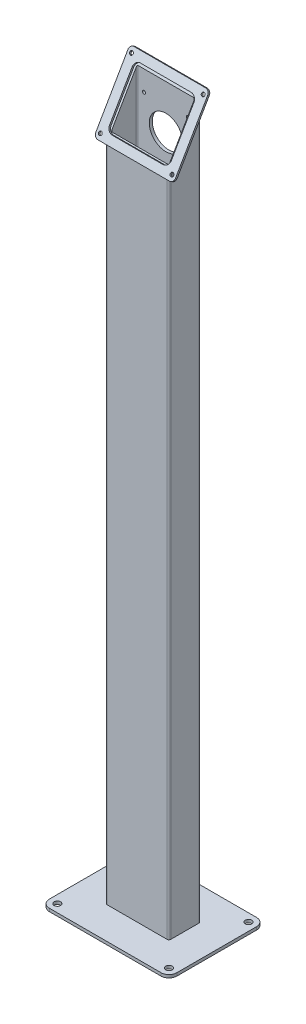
ISO-10303-21;
HEADER;
FILE_DESCRIPTION(('STEP AP214'),'2;1');
FILE_NAME('part.step','',(''),(''),'','','');
FILE_SCHEMA(('AUTOMOTIVE_DESIGN { 1 0 10303 214 1 1 1 1 }'));
ENDSEC;
DATA;
#1=APPLICATION_CONTEXT('core data for automotive mechanical design processes');
#2=APPLICATION_PROTOCOL_DEFINITION('international standard','automotive_design',2000,#1);
#3=PRODUCT_CONTEXT('',#1,'mechanical');
#4=PRODUCT('Part','Part','',(#3));
#5=PRODUCT_RELATED_PRODUCT_CATEGORY('part','',(#4));
#6=PRODUCT_DEFINITION_FORMATION('','',#4);
#7=PRODUCT_DEFINITION_CONTEXT('part definition',#1,'design');
#8=PRODUCT_DEFINITION('design','',#6,#7);
#9=PRODUCT_DEFINITION_SHAPE('','',#8);
#10=(LENGTH_UNIT() NAMED_UNIT(*) SI_UNIT(.MILLI.,.METRE.));
#11=(NAMED_UNIT(*) PLANE_ANGLE_UNIT() SI_UNIT($,.RADIAN.));
#12=(NAMED_UNIT(*) SI_UNIT($,.STERADIAN.) SOLID_ANGLE_UNIT());
#13=UNCERTAINTY_MEASURE_WITH_UNIT(LENGTH_MEASURE(1.E-05),#10,'distance_accuracy_value','');
#14=(GEOMETRIC_REPRESENTATION_CONTEXT(3) GLOBAL_UNCERTAINTY_ASSIGNED_CONTEXT((#13)) GLOBAL_UNIT_ASSIGNED_CONTEXT((#10,
#11,#12)) REPRESENTATION_CONTEXT('',''));
#15=CARTESIAN_POINT('',(0.,0.,0.));
#16=DIRECTION('',(0.,0.,1.));
#17=DIRECTION('',(1.,0.,0.));
#18=AXIS2_PLACEMENT_3D('',#15,#16,#17);
#19=CARTESIAN_POINT('',(-50.8,1206.5,-25.4));
#20=DIRECTION('',(0.,0.,1.));
#21=DIRECTION('',(1.,0.,0.));
#22=AXIS2_PLACEMENT_3D('',#19,#20,#21);
#23=PLANE('',#22);
#24=CARTESIAN_POINT('',(0.,1071.5752,-25.4));
#25=DIRECTION('',(0.,0.,-1.));
#26=DIRECTION('',(-1.,0.,0.));
#27=AXIS2_PLACEMENT_3D('',#24,#25,#26);
#28=CIRCLE('',#27,26.5429999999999);
#29=CARTESIAN_POINT('',(-26.5429999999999,1071.5752,-25.4));
#30=VERTEX_POINT('',#29);
#31=EDGE_CURVE('E910',#30,#30,#28,.T.);
#32=ORIENTED_EDGE('',*,*,#31,.F.);
#33=EDGE_LOOP('',(#32));
#34=FACE_BOUND('',#33,.T.);
#35=CARTESIAN_POINT('',(34.925,1109.6752,-25.4));
#36=DIRECTION('',(0.,0.,-1.));
#37=DIRECTION('',(-1.,0.,0.));
#38=AXIS2_PLACEMENT_3D('',#35,#36,#37);
#39=CIRCLE('',#38,2.5527);
#40=CARTESIAN_POINT('',(32.3723,1109.6752,-25.4));
#41=VERTEX_POINT('',#40);
#42=EDGE_CURVE('E914',#41,#41,#39,.T.);
#43=ORIENTED_EDGE('',*,*,#42,.F.);
#44=EDGE_LOOP('',(#43));
#45=FACE_BOUND('',#44,.T.);
#46=CARTESIAN_POINT('',(-34.925,1109.6752,-25.4));
#47=DIRECTION('',(0.,0.,-1.));
#48=DIRECTION('',(-1.,0.,0.));
#49=AXIS2_PLACEMENT_3D('',#46,#47,#48);
#50=CIRCLE('',#49,2.5527);
#51=CARTESIAN_POINT('',(-37.4777,1109.6752,-25.4));
#52=VERTEX_POINT('',#51);
#53=EDGE_CURVE('E923',#52,#52,#50,.T.);
#54=ORIENTED_EDGE('',*,*,#53,.F.);
#55=EDGE_LOOP('',(#54));
#56=FACE_BOUND('',#55,.T.);
#57=CARTESIAN_POINT('',(-34.925,658.8252,-25.4));
#58=DIRECTION('',(0.,0.,-1.));
#59=DIRECTION('',(-1.,0.,0.));
#60=AXIS2_PLACEMENT_3D('',#57,#58,#59);
#61=CIRCLE('',#60,2.5527);
#62=CARTESIAN_POINT('',(-37.4777,658.8252,-25.4));
#63=VERTEX_POINT('',#62);
#64=EDGE_CURVE('E947',#63,#63,#61,.T.);
#65=ORIENTED_EDGE('',*,*,#64,.F.);
#66=EDGE_LOOP('',(#65));
#67=FACE_BOUND('',#66,.T.);
#68=CARTESIAN_POINT('',(34.925,207.9752,-25.4));
#69=DIRECTION('',(0.,0.,-1.));
#70=DIRECTION('',(-1.,0.,0.));
#71=AXIS2_PLACEMENT_3D('',#68,#69,#70);
#72=CIRCLE('',#71,2.5527);
#73=CARTESIAN_POINT('',(32.3723,207.9752,-25.4));
#74=VERTEX_POINT('',#73);
#75=EDGE_CURVE('E959',#74,#74,#72,.T.);
#76=ORIENTED_EDGE('',*,*,#75,.F.);
#77=EDGE_LOOP('',(#76));
#78=FACE_BOUND('',#77,.T.);
#79=DIRECTION('',(1.,0.,0.));
#80=VECTOR('',#79,1.);
#81=CARTESIAN_POINT('',(88.9,4.7752,-25.4));
#82=LINE('',#81,#80);
#83=CARTESIAN_POINT('',(-47.8,4.7752,-25.4));
#84=VERTEX_POINT('',#83);
#85=CARTESIAN_POINT('',(47.8,4.7752,-25.4));
#86=VERTEX_POINT('',#85);
#87=EDGE_CURVE('E447',#84,#86,#82,.T.);
#88=ORIENTED_EDGE('',*,*,#87,.F.);
#89=DIRECTION('',(0.,-1.,0.));
#90=VECTOR('',#89,1.);
#91=CARTESIAN_POINT('',(-47.8,1206.5,-25.4));
#92=LINE('',#91,#90);
#93=CARTESIAN_POINT('',(-47.8,1150.19074,-25.4));
#94=VERTEX_POINT('',#93);
#95=EDGE_CURVE('E543',#84,#94,#92,.F.);
#96=ORIENTED_EDGE('',*,*,#95,.T.);
#97=DIRECTION('',(1.,0.,0.));
#98=VECTOR('',#97,1.);
#99=CARTESIAN_POINT('',(-101.6,1150.19074,-25.4));
#100=LINE('',#99,#98);
#101=CARTESIAN_POINT('',(47.8,1150.19074,-25.4));
#102=VERTEX_POINT('',#101);
#103=EDGE_CURVE('E433',#94,#102,#100,.T.);
#104=ORIENTED_EDGE('',*,*,#103,.T.);
#105=DIRECTION('',(0.,-1.,0.));
#106=VECTOR('',#105,1.);
#107=CARTESIAN_POINT('',(47.8,1206.5,-25.4));
#108=LINE('',#107,#106);
#109=EDGE_CURVE('E540',#102,#86,#108,.T.);
#110=ORIENTED_EDGE('',*,*,#109,.T.);
#111=EDGE_LOOP('',(#88,#96,#104,#110));
#112=FACE_BOUND('',#111,.T.);
#113=CARTESIAN_POINT('',(-34.925,207.9752,-25.4));
#114=DIRECTION('',(0.,0.,-1.));
#115=DIRECTION('',(-1.,0.,0.));
#116=AXIS2_PLACEMENT_3D('',#113,#114,#115);
#117=CIRCLE('',#116,2.5527);
#118=CARTESIAN_POINT('',(-37.4777,207.9752,-25.4));
#119=VERTEX_POINT('',#118);
#120=EDGE_CURVE('E953',#119,#119,#117,.T.);
#121=ORIENTED_EDGE('',*,*,#120,.F.);
#122=EDGE_LOOP('',(#121));
#123=FACE_BOUND('',#122,.T.);
#124=CARTESIAN_POINT('',(34.925,658.8252,-25.4));
#125=DIRECTION('',(0.,0.,-1.));
#126=DIRECTION('',(-1.,0.,0.));
#127=AXIS2_PLACEMENT_3D('',#124,#125,#126);
#128=CIRCLE('',#127,2.5527);
#129=CARTESIAN_POINT('',(32.3723,658.8252,-25.4));
#130=VERTEX_POINT('',#129);
#131=EDGE_CURVE('E941',#130,#130,#128,.T.);
#132=ORIENTED_EDGE('',*,*,#131,.F.);
#133=EDGE_LOOP('',(#132));
#134=FACE_BOUND('',#133,.T.);
#135=CARTESIAN_POINT('',(34.925,792.1752,-25.4));
#136=DIRECTION('',(0.,0.,-1.));
#137=DIRECTION('',(-1.,0.,0.));
#138=AXIS2_PLACEMENT_3D('',#135,#136,#137);
#139=CIRCLE('',#138,2.5527);
#140=CARTESIAN_POINT('',(32.3723,792.1752,-25.4));
#141=VERTEX_POINT('',#140);
#142=EDGE_CURVE('E935',#141,#141,#139,.T.);
#143=ORIENTED_EDGE('',*,*,#142,.F.);
#144=EDGE_LOOP('',(#143));
#145=FACE_BOUND('',#144,.T.);
#146=CARTESIAN_POINT('',(-34.925,792.1752,-25.4));
#147=DIRECTION('',(0.,0.,-1.));
#148=DIRECTION('',(-1.,0.,0.));
#149=AXIS2_PLACEMENT_3D('',#146,#147,#148);
#150=CIRCLE('',#149,2.5527);
#151=CARTESIAN_POINT('',(-37.4777,792.1752,-25.4));
#152=VERTEX_POINT('',#151);
#153=EDGE_CURVE('E929',#152,#152,#150,.T.);
#154=ORIENTED_EDGE('',*,*,#153,.F.);
#155=EDGE_LOOP('',(#154));
#156=FACE_BOUND('',#155,.T.);
#157=ADVANCED_FACE('F34',(#34,#45,#56,#67,#78,#112,#123,#134,#145,#156),#23,.F.);
#158=CARTESIAN_POINT('',(88.9,4.7752,63.5));
#159=DIRECTION('',(0.,1.,0.));
#160=DIRECTION('',(0.,0.,1.));
#161=AXIS2_PLACEMENT_3D('',#158,#159,#160);
#162=PLANE('',#161);
#163=CARTESIAN_POINT('',(-88.9,4.7752,-63.5));
#164=DIRECTION('',(0.,1.,0.));
#165=DIRECTION('',(0.,0.,1.));
#166=AXIS2_PLACEMENT_3D('',#163,#164,#165);
#167=CIRCLE('',#166,5.19999999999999);
#168=CARTESIAN_POINT('',(-88.9,4.7752,-58.3));
#169=VERTEX_POINT('',#168);
#170=EDGE_CURVE('E454',#169,#169,#167,.T.);
#171=ORIENTED_EDGE('',*,*,#170,.F.);
#172=EDGE_LOOP('',(#171));
#173=FACE_BOUND('',#172,.T.);
#174=CARTESIAN_POINT('',(88.9,4.7752,63.5));
#175=DIRECTION('',(0.,1.,0.));
#176=DIRECTION('',(0.,0.,1.));
#177=AXIS2_PLACEMENT_3D('',#174,#175,#176);
#178=CIRCLE('',#177,5.19999999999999);
#179=CARTESIAN_POINT('',(88.9,4.7752,68.7));
#180=VERTEX_POINT('',#179);
#181=EDGE_CURVE('E460',#180,#180,#178,.T.);
#182=ORIENTED_EDGE('',*,*,#181,.F.);
#183=EDGE_LOOP('',(#182));
#184=FACE_BOUND('',#183,.T.);
#185=CARTESIAN_POINT('',(-88.9,4.7752,63.5));
#186=DIRECTION('',(0.,1.,0.));
#187=DIRECTION('',(0.,0.,1.));
#188=AXIS2_PLACEMENT_3D('',#185,#186,#187);
#189=CIRCLE('',#188,5.19999999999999);
#190=CARTESIAN_POINT('',(-88.9,4.7752,68.7));
#191=VERTEX_POINT('',#190);
#192=EDGE_CURVE('E466',#191,#191,#189,.T.);
#193=ORIENTED_EDGE('',*,*,#192,.F.);
#194=EDGE_LOOP('',(#193));
#195=FACE_BOUND('',#194,.T.);
#196=CARTESIAN_POINT('',(88.9,4.7752,-63.5));
#197=DIRECTION('',(0.,1.,0.));
#198=DIRECTION('',(0.,0.,1.));
#199=AXIS2_PLACEMENT_3D('',#196,#197,#198);
#200=CIRCLE('',#199,5.19999999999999);
#201=CARTESIAN_POINT('',(88.9,4.7752,-58.3));
#202=VERTEX_POINT('',#201);
#203=EDGE_CURVE('E472',#202,#202,#200,.T.);
#204=ORIENTED_EDGE('',*,*,#203,.F.);
#205=EDGE_LOOP('',(#204));
#206=FACE_BOUND('',#205,.T.);
#207=CARTESIAN_POINT('',(88.9,4.7752,63.5));
#208=DIRECTION('',(0.,1.,0.));
#209=DIRECTION('',(0.,0.,1.));
#210=AXIS2_PLACEMENT_3D('',#207,#208,#209);
#211=CIRCLE('',#210,12.7);
#212=CARTESIAN_POINT('',(88.8999999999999,4.7752,76.2));
#213=VERTEX_POINT('',#212);
#214=CARTESIAN_POINT('',(101.6,4.7752,63.4999999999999));
#215=VERTEX_POINT('',#214);
#216=EDGE_CURVE('E478',#213,#215,#211,.T.);
#217=ORIENTED_EDGE('',*,*,#216,.T.);
#218=DIRECTION('',(0.,0.,-1.));
#219=VECTOR('',#218,1.);
#220=CARTESIAN_POINT('',(101.6,4.7752,-63.4999999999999));
#221=LINE('',#220,#219);
#222=CARTESIAN_POINT('',(101.6,4.7752,-63.4999999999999));
#223=VERTEX_POINT('',#222);
#224=EDGE_CURVE('E481',#215,#223,#221,.T.);
#225=ORIENTED_EDGE('',*,*,#224,.T.);
#226=CARTESIAN_POINT('',(88.9,4.7752,-63.5));
#227=DIRECTION('',(0.,1.,0.));
#228=DIRECTION('',(0.,0.,-1.));
#229=AXIS2_PLACEMENT_3D('',#226,#227,#228);
#230=CIRCLE('',#229,12.7);
#231=CARTESIAN_POINT('',(88.8999999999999,4.7752,-76.2));
#232=VERTEX_POINT('',#231);
#233=EDGE_CURVE('E484',#223,#232,#230,.T.);
#234=ORIENTED_EDGE('',*,*,#233,.T.);
#235=DIRECTION('',(-1.,0.,0.));
#236=VECTOR('',#235,1.);
#237=CARTESIAN_POINT('',(-88.8999999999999,4.7752,-76.2));
#238=LINE('',#237,#236);
#239=CARTESIAN_POINT('',(-88.8999999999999,4.7752,-76.2));
#240=VERTEX_POINT('',#239);
#241=EDGE_CURVE('E486',#232,#240,#238,.T.);
#242=ORIENTED_EDGE('',*,*,#241,.T.);
#243=CARTESIAN_POINT('',(-88.9,4.7752,-63.5));
#244=DIRECTION('',(0.,1.,0.));
#245=DIRECTION('',(0.,0.,1.));
#246=AXIS2_PLACEMENT_3D('',#243,#244,#245);
#247=CIRCLE('',#246,12.7);
#248=CARTESIAN_POINT('',(-101.6,4.7752,-63.4999999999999));
#249=VERTEX_POINT('',#248);
#250=EDGE_CURVE('E488',#240,#249,#247,.T.);
#251=ORIENTED_EDGE('',*,*,#250,.T.);
#252=DIRECTION('',(0.,0.,1.));
#253=VECTOR('',#252,1.);
#254=CARTESIAN_POINT('',(-101.6,4.7752,-63.4999999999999));
#255=LINE('',#254,#253);
#256=CARTESIAN_POINT('',(-101.6,4.7752,63.4999999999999));
#257=VERTEX_POINT('',#256);
#258=EDGE_CURVE('E490',#249,#257,#255,.T.);
#259=ORIENTED_EDGE('',*,*,#258,.T.);
#260=CARTESIAN_POINT('',(-88.8999999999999,4.7752,63.5));
#261=DIRECTION('',(0.,1.,0.));
#262=DIRECTION('',(0.,0.,1.));
#263=AXIS2_PLACEMENT_3D('',#260,#261,#262);
#264=CIRCLE('',#263,12.7);
#265=CARTESIAN_POINT('',(-88.8999999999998,4.7752,76.2));
#266=VERTEX_POINT('',#265);
#267=EDGE_CURVE('E492',#257,#266,#264,.T.);
#268=ORIENTED_EDGE('',*,*,#267,.T.);
#269=DIRECTION('',(1.,0.,0.));
#270=VECTOR('',#269,1.);
#271=CARTESIAN_POINT('',(-88.8999999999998,4.7752,76.2));
#272=LINE('',#271,#270);
#273=EDGE_CURVE('E494',#266,#213,#272,.T.);
#274=ORIENTED_EDGE('',*,*,#273,.T.);
#275=EDGE_LOOP('',(#217,#225,#234,#242,#251,#259,#268,#274));
#276=FACE_BOUND('',#275,.T.);
#277=DIRECTION('',(0.,0.,-1.));
#278=VECTOR('',#277,1.);
#279=CARTESIAN_POINT('',(-50.8,4.7752,63.5));
#280=LINE('',#279,#278);
#281=CARTESIAN_POINT('',(-50.8,4.7752,22.4));
#282=VERTEX_POINT('',#281);
#283=CARTESIAN_POINT('',(-50.8,4.7752,-22.4));
#284=VERTEX_POINT('',#283);
#285=EDGE_CURVE('E444',#282,#284,#280,.T.);
#286=ORIENTED_EDGE('',*,*,#285,.T.);
#287=CARTESIAN_POINT('',(-47.8,4.77520000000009,-22.4));
#288=DIRECTION('',(0.,1.,0.));
#289=DIRECTION('',(0.,0.,1.));
#290=AXIS2_PLACEMENT_3D('',#287,#288,#289);
#291=CIRCLE('',#290,3.);
#292=EDGE_CURVE('E567',#284,#84,#291,.F.);
#293=ORIENTED_EDGE('',*,*,#292,.T.);
#294=ORIENTED_EDGE('',*,*,#87,.T.);
#295=CARTESIAN_POINT('',(47.8,4.77520000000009,-22.4));
#296=DIRECTION('',(0.,1.,0.));
#297=DIRECTION('',(0.,0.,1.));
#298=AXIS2_PLACEMENT_3D('',#295,#296,#297);
#299=CIRCLE('',#298,3.);
#300=CARTESIAN_POINT('',(50.8,4.7752,-22.4));
#301=VERTEX_POINT('',#300);
#302=EDGE_CURVE('E569',#86,#301,#299,.F.);
#303=ORIENTED_EDGE('',*,*,#302,.T.);
#304=DIRECTION('',(0.,0.,1.));
#305=VECTOR('',#304,1.);
#306=CARTESIAN_POINT('',(50.8,4.7752,63.5));
#307=LINE('',#306,#305);
#308=CARTESIAN_POINT('',(50.8,4.7752,22.4));
#309=VERTEX_POINT('',#308);
#310=EDGE_CURVE('E450',#301,#309,#307,.T.);
#311=ORIENTED_EDGE('',*,*,#310,.T.);
#312=CARTESIAN_POINT('',(47.8,4.77520000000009,22.4));
#313=DIRECTION('',(0.,1.,0.));
#314=DIRECTION('',(0.,0.,1.));
#315=AXIS2_PLACEMENT_3D('',#312,#313,#314);
#316=CIRCLE('',#315,3.);
#317=CARTESIAN_POINT('',(47.8,4.7752,25.4));
#318=VERTEX_POINT('',#317);
#319=EDGE_CURVE('E571',#309,#318,#316,.F.);
#320=ORIENTED_EDGE('',*,*,#319,.T.);
#321=DIRECTION('',(-1.,0.,0.));
#322=VECTOR('',#321,1.);
#323=CARTESIAN_POINT('',(88.9,4.7752,25.4));
#324=LINE('',#323,#322);
#325=CARTESIAN_POINT('',(-47.8,4.7752,25.4));
#326=VERTEX_POINT('',#325);
#327=EDGE_CURVE('E441',#318,#326,#324,.T.);
#328=ORIENTED_EDGE('',*,*,#327,.T.);
#329=CARTESIAN_POINT('',(-47.8,4.77520000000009,22.4));
#330=DIRECTION('',(0.,1.,0.));
#331=DIRECTION('',(0.,0.,1.));
#332=AXIS2_PLACEMENT_3D('',#329,#330,#331);
#333=CIRCLE('',#332,3.);
#334=EDGE_CURVE('E573',#326,#282,#333,.F.);
#335=ORIENTED_EDGE('',*,*,#334,.T.);
#336=EDGE_LOOP('',(#286,#293,#294,#303,#311,#320,#328,#335));
#337=FACE_BOUND('',#336,.T.);
#338=ADVANCED_FACE('F663',(#173,#184,#195,#206,#276,#337),#162,.T.);
#339=CARTESIAN_POINT('',(88.9,4.7752,63.5));
#340=DIRECTION('',(0.,-1.,0.));
#341=DIRECTION('',(0.,0.,-1.));
#342=AXIS2_PLACEMENT_3D('',#339,#340,#341);
#343=CYLINDRICAL_SURFACE('',#342,12.7);
#344=CARTESIAN_POINT('',(88.9,0.,63.5));
#345=DIRECTION('',(0.,1.,0.));
#346=DIRECTION('',(0.,0.,1.));
#347=AXIS2_PLACEMENT_3D('',#344,#345,#346);
#348=CIRCLE('',#347,12.7);
#349=CARTESIAN_POINT('',(88.8999999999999,0.,76.2));
#350=VERTEX_POINT('',#349);
#351=CARTESIAN_POINT('',(101.6,0.,63.4999999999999));
#352=VERTEX_POINT('',#351);
#353=EDGE_CURVE('E475',#350,#352,#348,.T.);
#354=ORIENTED_EDGE('',*,*,#353,.T.);
#355=DIRECTION('',(0.,-1.,0.));
#356=VECTOR('',#355,1.);
#357=CARTESIAN_POINT('',(101.6,4.7752,63.4999999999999));
#358=LINE('',#357,#356);
#359=EDGE_CURVE('E532',#215,#352,#358,.T.);
#360=ORIENTED_EDGE('',*,*,#359,.F.);
#361=ORIENTED_EDGE('',*,*,#216,.F.);
#362=DIRECTION('',(0.,-1.,0.));
#363=VECTOR('',#362,1.);
#364=CARTESIAN_POINT('',(88.8999999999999,4.7752,76.2));
#365=LINE('',#364,#363);
#366=EDGE_CURVE('E496',#213,#350,#365,.T.);
#367=ORIENTED_EDGE('',*,*,#366,.T.);
#368=EDGE_LOOP('',(#354,#360,#361,#367));
#369=FACE_BOUND('',#368,.T.);
#370=ADVANCED_FACE('F669',(#369),#343,.T.);
#371=CARTESIAN_POINT('',(101.6,4.7752,-63.4999999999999));
#372=DIRECTION('',(-1.,0.,0.));
#373=DIRECTION('',(0.,0.,1.));
#374=AXIS2_PLACEMENT_3D('',#371,#372,#373);
#375=PLANE('',#374);
#376=DIRECTION('',(0.,0.,-1.));
#377=VECTOR('',#376,1.);
#378=CARTESIAN_POINT('',(101.6,0.,-63.4999999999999));
#379=LINE('',#378,#377);
#380=CARTESIAN_POINT('',(101.6,0.,-63.4999999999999));
#381=VERTEX_POINT('',#380);
#382=EDGE_CURVE('E499',#352,#381,#379,.T.);
#383=ORIENTED_EDGE('',*,*,#382,.T.);
#384=DIRECTION('',(0.,-1.,0.));
#385=VECTOR('',#384,1.);
#386=CARTESIAN_POINT('',(101.6,4.7752,-63.4999999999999));
#387=LINE('',#386,#385);
#388=EDGE_CURVE('E529',#223,#381,#387,.T.);
#389=ORIENTED_EDGE('',*,*,#388,.F.);
#390=ORIENTED_EDGE('',*,*,#224,.F.);
#391=ORIENTED_EDGE('',*,*,#359,.T.);
#392=EDGE_LOOP('',(#383,#389,#390,#391));
#393=FACE_BOUND('',#392,.T.);
#394=ADVANCED_FACE('F723',(#393),#375,.F.);
#395=CARTESIAN_POINT('',(88.9,4.7752,-63.5));
#396=DIRECTION('',(0.,-1.,0.));
#397=DIRECTION('',(0.,0.,-1.));
#398=AXIS2_PLACEMENT_3D('',#395,#396,#397);
#399=CYLINDRICAL_SURFACE('',#398,12.7);
#400=CARTESIAN_POINT('',(88.9,0.,-63.5));
#401=DIRECTION('',(0.,1.,0.));
#402=DIRECTION('',(0.,0.,-1.));
#403=AXIS2_PLACEMENT_3D('',#400,#401,#402);
#404=CIRCLE('',#403,12.7);
#405=CARTESIAN_POINT('',(88.8999999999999,0.,-76.2));
#406=VERTEX_POINT('',#405);
#407=EDGE_CURVE('E501',#381,#406,#404,.T.);
#408=ORIENTED_EDGE('',*,*,#407,.T.);
#409=DIRECTION('',(0.,-1.,0.));
#410=VECTOR('',#409,1.);
#411=CARTESIAN_POINT('',(88.8999999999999,4.7752,-76.2));
#412=LINE('',#411,#410);
#413=EDGE_CURVE('E526',#232,#406,#412,.T.);
#414=ORIENTED_EDGE('',*,*,#413,.F.);
#415=ORIENTED_EDGE('',*,*,#233,.F.);
#416=ORIENTED_EDGE('',*,*,#388,.T.);
#417=EDGE_LOOP('',(#408,#414,#415,#416));
#418=FACE_BOUND('',#417,.T.);
#419=ADVANCED_FACE('F719',(#418),#399,.T.);
#420=CARTESIAN_POINT('',(-88.8999999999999,4.7752,-76.2));
#421=DIRECTION('',(0.,0.,1.));
#422=DIRECTION('',(1.,0.,0.));
#423=AXIS2_PLACEMENT_3D('',#420,#421,#422);
#424=PLANE('',#423);
#425=DIRECTION('',(-1.,0.,0.));
#426=VECTOR('',#425,1.);
#427=CARTESIAN_POINT('',(-88.8999999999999,0.,-76.2));
#428=LINE('',#427,#426);
#429=CARTESIAN_POINT('',(-88.8999999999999,0.,-76.2));
#430=VERTEX_POINT('',#429);
#431=EDGE_CURVE('E503',#406,#430,#428,.T.);
#432=ORIENTED_EDGE('',*,*,#431,.T.);
#433=DIRECTION('',(0.,-1.,0.));
#434=VECTOR('',#433,1.);
#435=CARTESIAN_POINT('',(-88.8999999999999,4.7752,-76.2));
#436=LINE('',#435,#434);
#437=EDGE_CURVE('E523',#240,#430,#436,.T.);
#438=ORIENTED_EDGE('',*,*,#437,.F.);
#439=ORIENTED_EDGE('',*,*,#241,.F.);
#440=ORIENTED_EDGE('',*,*,#413,.T.);
#441=EDGE_LOOP('',(#432,#438,#439,#440));
#442=FACE_BOUND('',#441,.T.);
#443=ADVANCED_FACE('F715',(#442),#424,.F.);
#444=CARTESIAN_POINT('',(-88.9,4.7752,-63.5));
#445=DIRECTION('',(0.,-1.,0.));
#446=DIRECTION('',(0.,0.,-1.));
#447=AXIS2_PLACEMENT_3D('',#444,#445,#446);
#448=CYLINDRICAL_SURFACE('',#447,12.7);
#449=CARTESIAN_POINT('',(-88.9,0.,-63.5));
#450=DIRECTION('',(0.,1.,0.));
#451=DIRECTION('',(0.,0.,1.));
#452=AXIS2_PLACEMENT_3D('',#449,#450,#451);
#453=CIRCLE('',#452,12.7);
#454=CARTESIAN_POINT('',(-101.6,0.,-63.4999999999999));
#455=VERTEX_POINT('',#454);
#456=EDGE_CURVE('E505',#430,#455,#453,.T.);
#457=ORIENTED_EDGE('',*,*,#456,.T.);
#458=DIRECTION('',(0.,-1.,0.));
#459=VECTOR('',#458,1.);
#460=CARTESIAN_POINT('',(-101.6,4.7752,-63.4999999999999));
#461=LINE('',#460,#459);
#462=EDGE_CURVE('E520',#249,#455,#461,.T.);
#463=ORIENTED_EDGE('',*,*,#462,.F.);
#464=ORIENTED_EDGE('',*,*,#250,.F.);
#465=ORIENTED_EDGE('',*,*,#437,.T.);
#466=EDGE_LOOP('',(#457,#463,#464,#465));
#467=FACE_BOUND('',#466,.T.);
#468=ADVANCED_FACE('F711',(#467),#448,.T.);
#469=CARTESIAN_POINT('',(-101.6,4.7752,-63.4999999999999));
#470=DIRECTION('',(1.,0.,0.));
#471=DIRECTION('',(0.,0.,-1.));
#472=AXIS2_PLACEMENT_3D('',#469,#470,#471);
#473=PLANE('',#472);
#474=DIRECTION('',(0.,0.,1.));
#475=VECTOR('',#474,1.);
#476=CARTESIAN_POINT('',(-101.6,0.,-63.4999999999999));
#477=LINE('',#476,#475);
#478=CARTESIAN_POINT('',(-101.6,0.,63.4999999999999));
#479=VERTEX_POINT('',#478);
#480=EDGE_CURVE('E507',#455,#479,#477,.T.);
#481=ORIENTED_EDGE('',*,*,#480,.T.);
#482=DIRECTION('',(0.,-1.,0.));
#483=VECTOR('',#482,1.);
#484=CARTESIAN_POINT('',(-101.6,4.7752,63.4999999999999));
#485=LINE('',#484,#483);
#486=EDGE_CURVE('E517',#257,#479,#485,.T.);
#487=ORIENTED_EDGE('',*,*,#486,.F.);
#488=ORIENTED_EDGE('',*,*,#258,.F.);
#489=ORIENTED_EDGE('',*,*,#462,.T.);
#490=EDGE_LOOP('',(#481,#487,#488,#489));
#491=FACE_BOUND('',#490,.T.);
#492=ADVANCED_FACE('F707',(#491),#473,.F.);
#493=CARTESIAN_POINT('',(-88.8999999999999,4.7752,63.5));
#494=DIRECTION('',(0.,-1.,0.));
#495=DIRECTION('',(0.,0.,-1.));
#496=AXIS2_PLACEMENT_3D('',#493,#494,#495);
#497=CYLINDRICAL_SURFACE('',#496,12.7);
#498=CARTESIAN_POINT('',(-88.8999999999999,0.,63.5));
#499=DIRECTION('',(0.,1.,0.));
#500=DIRECTION('',(0.,0.,1.));
#501=AXIS2_PLACEMENT_3D('',#498,#499,#500);
#502=CIRCLE('',#501,12.7);
#503=CARTESIAN_POINT('',(-88.8999999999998,0.,76.2));
#504=VERTEX_POINT('',#503);
#505=EDGE_CURVE('E509',#479,#504,#502,.T.);
#506=ORIENTED_EDGE('',*,*,#505,.T.);
#507=DIRECTION('',(0.,-1.,0.));
#508=VECTOR('',#507,1.);
#509=CARTESIAN_POINT('',(-88.8999999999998,4.7752,76.2));
#510=LINE('',#509,#508);
#511=EDGE_CURVE('E514',#266,#504,#510,.T.);
#512=ORIENTED_EDGE('',*,*,#511,.F.);
#513=ORIENTED_EDGE('',*,*,#267,.F.);
#514=ORIENTED_EDGE('',*,*,#486,.T.);
#515=EDGE_LOOP('',(#506,#512,#513,#514));
#516=FACE_BOUND('',#515,.T.);
#517=ADVANCED_FACE('F703',(#516),#497,.T.);
#518=CARTESIAN_POINT('',(-88.8999999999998,4.7752,76.2));
#519=DIRECTION('',(0.,0.,-1.));
#520=DIRECTION('',(-1.,0.,0.));
#521=AXIS2_PLACEMENT_3D('',#518,#519,#520);
#522=PLANE('',#521);
#523=DIRECTION('',(1.,0.,0.));
#524=VECTOR('',#523,1.);
#525=CARTESIAN_POINT('',(-88.8999999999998,0.,76.2));
#526=LINE('',#525,#524);
#527=EDGE_CURVE('E482',#504,#350,#526,.T.);
#528=ORIENTED_EDGE('',*,*,#527,.T.);
#529=ORIENTED_EDGE('',*,*,#366,.F.);
#530=ORIENTED_EDGE('',*,*,#273,.F.);
#531=ORIENTED_EDGE('',*,*,#511,.T.);
#532=EDGE_LOOP('',(#528,#529,#530,#531));
#533=FACE_BOUND('',#532,.T.);
#534=ADVANCED_FACE('F700',(#533),#522,.F.);
#535=CARTESIAN_POINT('',(88.9,0.,63.5));
#536=DIRECTION('',(0.,1.,0.));
#537=DIRECTION('',(0.,0.,1.));
#538=AXIS2_PLACEMENT_3D('',#535,#536,#537);
#539=PLANE('',#538);
#540=DIRECTION('',(0.,0.,-1.));
#541=VECTOR('',#540,1.);
#542=CARTESIAN_POINT('',(-46.0248,0.,20.6248));
#543=LINE('',#542,#541);
#544=CARTESIAN_POINT('',(-46.0248,0.,19.1248));
#545=VERTEX_POINT('',#544);
#546=CARTESIAN_POINT('',(-46.0248,0.,-19.1248));
#547=VERTEX_POINT('',#546);
#548=EDGE_CURVE('E424',#545,#547,#543,.T.);
#549=ORIENTED_EDGE('',*,*,#548,.F.);
#550=CARTESIAN_POINT('',(-44.5248,0.,19.1248));
#551=DIRECTION('',(0.,1.,0.));
#552=DIRECTION('',(0.,0.,1.));
#553=AXIS2_PLACEMENT_3D('',#550,#551,#552);
#554=CIRCLE('',#553,1.5);
#555=CARTESIAN_POINT('',(-44.5248,0.,20.6248));
#556=VERTEX_POINT('',#555);
#557=EDGE_CURVE('E609',#545,#556,#554,.T.);
#558=ORIENTED_EDGE('',*,*,#557,.T.);
#559=DIRECTION('',(-1.,0.,0.));
#560=VECTOR('',#559,1.);
#561=CARTESIAN_POINT('',(46.0248,0.,20.6248));
#562=LINE('',#561,#560);
#563=CARTESIAN_POINT('',(44.5248,0.,20.6248));
#564=VERTEX_POINT('',#563);
#565=EDGE_CURVE('E421',#564,#556,#562,.T.);
#566=ORIENTED_EDGE('',*,*,#565,.F.);
#567=CARTESIAN_POINT('',(44.5248,0.,19.1248));
#568=DIRECTION('',(0.,1.,0.));
#569=DIRECTION('',(0.,0.,1.));
#570=AXIS2_PLACEMENT_3D('',#567,#568,#569);
#571=CIRCLE('',#570,1.5);
#572=CARTESIAN_POINT('',(46.0248,0.,19.1248));
#573=VERTEX_POINT('',#572);
#574=EDGE_CURVE('E613',#564,#573,#571,.T.);
#575=ORIENTED_EDGE('',*,*,#574,.T.);
#576=DIRECTION('',(0.,0.,1.));
#577=VECTOR('',#576,1.);
#578=CARTESIAN_POINT('',(46.0248,0.,-20.6248));
#579=LINE('',#578,#577);
#580=CARTESIAN_POINT('',(46.0248,0.,-19.1248));
#581=VERTEX_POINT('',#580);
#582=EDGE_CURVE('E430',#581,#573,#579,.T.);
#583=ORIENTED_EDGE('',*,*,#582,.F.);
#584=CARTESIAN_POINT('',(44.5248,0.,-19.1248));
#585=DIRECTION('',(0.,1.,0.));
#586=DIRECTION('',(0.,0.,1.));
#587=AXIS2_PLACEMENT_3D('',#584,#585,#586);
#588=CIRCLE('',#587,1.5);
#589=CARTESIAN_POINT('',(44.5248,0.,-20.6248));
#590=VERTEX_POINT('',#589);
#591=EDGE_CURVE('E42',#581,#590,#588,.T.);
#592=ORIENTED_EDGE('',*,*,#591,.T.);
#593=DIRECTION('',(1.,0.,0.));
#594=VECTOR('',#593,1.);
#595=CARTESIAN_POINT('',(-46.0248,0.,-20.6248));
#596=LINE('',#595,#594);
#597=CARTESIAN_POINT('',(-44.5248,0.,-20.6248));
#598=VERTEX_POINT('',#597);
#599=EDGE_CURVE('E427',#598,#590,#596,.T.);
#600=ORIENTED_EDGE('',*,*,#599,.F.);
#601=CARTESIAN_POINT('',(-44.5248,0.,-19.1248));
#602=DIRECTION('',(0.,1.,0.));
#603=DIRECTION('',(0.,0.,1.));
#604=AXIS2_PLACEMENT_3D('',#601,#602,#603);
#605=CIRCLE('',#604,1.5);
#606=EDGE_CURVE('E605',#598,#547,#605,.T.);
#607=ORIENTED_EDGE('',*,*,#606,.T.);
#608=EDGE_LOOP('',(#549,#558,#566,#575,#583,#592,#600,#607));
#609=FACE_BOUND('',#608,.T.);
#610=ORIENTED_EDGE('',*,*,#353,.F.);
#611=ORIENTED_EDGE('',*,*,#527,.F.);
#612=ORIENTED_EDGE('',*,*,#505,.F.);
#613=ORIENTED_EDGE('',*,*,#480,.F.);
#614=ORIENTED_EDGE('',*,*,#456,.F.);
#615=ORIENTED_EDGE('',*,*,#431,.F.);
#616=ORIENTED_EDGE('',*,*,#407,.F.);
#617=ORIENTED_EDGE('',*,*,#382,.F.);
#618=EDGE_LOOP('',(#610,#611,#612,#613,#614,#615,#616,#617));
#619=FACE_BOUND('',#618,.T.);
#620=CARTESIAN_POINT('',(88.9,0.,-63.5));
#621=DIRECTION('',(0.,1.,0.));
#622=DIRECTION('',(0.,0.,1.));
#623=AXIS2_PLACEMENT_3D('',#620,#621,#622);
#624=CIRCLE('',#623,5.19999999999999);
#625=CARTESIAN_POINT('',(88.9,0.,-58.3));
#626=VERTEX_POINT('',#625);
#627=EDGE_CURVE('E469',#626,#626,#624,.T.);
#628=ORIENTED_EDGE('',*,*,#627,.T.);
#629=EDGE_LOOP('',(#628));
#630=FACE_BOUND('',#629,.T.);
#631=CARTESIAN_POINT('',(-88.9,0.,63.5));
#632=DIRECTION('',(0.,1.,0.));
#633=DIRECTION('',(0.,0.,1.));
#634=AXIS2_PLACEMENT_3D('',#631,#632,#633);
#635=CIRCLE('',#634,5.19999999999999);
#636=CARTESIAN_POINT('',(-88.9,0.,68.7));
#637=VERTEX_POINT('',#636);
#638=EDGE_CURVE('E463',#637,#637,#635,.T.);
#639=ORIENTED_EDGE('',*,*,#638,.T.);
#640=EDGE_LOOP('',(#639));
#641=FACE_BOUND('',#640,.T.);
#642=CARTESIAN_POINT('',(88.9,0.,63.5));
#643=DIRECTION('',(0.,1.,0.));
#644=DIRECTION('',(0.,0.,1.));
#645=AXIS2_PLACEMENT_3D('',#642,#643,#644);
#646=CIRCLE('',#645,5.19999999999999);
#647=CARTESIAN_POINT('',(88.9,0.,68.7));
#648=VERTEX_POINT('',#647);
#649=EDGE_CURVE('E457',#648,#648,#646,.T.);
#650=ORIENTED_EDGE('',*,*,#649,.T.);
#651=EDGE_LOOP('',(#650));
#652=FACE_BOUND('',#651,.T.);
#653=CARTESIAN_POINT('',(-88.9,0.,-63.5));
#654=DIRECTION('',(0.,1.,0.));
#655=DIRECTION('',(0.,0.,1.));
#656=AXIS2_PLACEMENT_3D('',#653,#654,#655);
#657=CIRCLE('',#656,5.19999999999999);
#658=CARTESIAN_POINT('',(-88.9,0.,-58.3));
#659=VERTEX_POINT('',#658);
#660=EDGE_CURVE('E453',#659,#659,#657,.T.);
#661=ORIENTED_EDGE('',*,*,#660,.T.);
#662=EDGE_LOOP('',(#661));
#663=FACE_BOUND('',#662,.T.);
#664=ADVANCED_FACE('F620',(#609,#619,#630,#641,#652,#663),#539,.F.);
#665=CARTESIAN_POINT('',(88.9,4.7752,-63.5));
#666=DIRECTION('',(0.,-1.,0.));
#667=DIRECTION('',(0.,0.,-1.));
#668=AXIS2_PLACEMENT_3D('',#665,#666,#667);
#669=CYLINDRICAL_SURFACE('',#668,5.19999999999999);
#670=ORIENTED_EDGE('',*,*,#203,.T.);
#671=EDGE_LOOP('',(#670));
#672=FACE_BOUND('',#671,.T.);
#673=ORIENTED_EDGE('',*,*,#627,.F.);
#674=EDGE_LOOP('',(#673));
#675=FACE_BOUND('',#674,.T.);
#676=ADVANCED_FACE('F693',(#672,#675),#669,.F.);
#677=CARTESIAN_POINT('',(-88.9,4.7752,63.5));
#678=DIRECTION('',(0.,-1.,0.));
#679=DIRECTION('',(0.,0.,-1.));
#680=AXIS2_PLACEMENT_3D('',#677,#678,#679);
#681=CYLINDRICAL_SURFACE('',#680,5.19999999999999);
#682=ORIENTED_EDGE('',*,*,#192,.T.);
#683=EDGE_LOOP('',(#682));
#684=FACE_BOUND('',#683,.T.);
#685=ORIENTED_EDGE('',*,*,#638,.F.);
#686=EDGE_LOOP('',(#685));
#687=FACE_BOUND('',#686,.T.);
#688=ADVANCED_FACE('F689',(#684,#687),#681,.F.);
#689=CARTESIAN_POINT('',(88.9,4.7752,63.5));
#690=DIRECTION('',(0.,-1.,0.));
#691=DIRECTION('',(0.,0.,-1.));
#692=AXIS2_PLACEMENT_3D('',#689,#690,#691);
#693=CYLINDRICAL_SURFACE('',#692,5.19999999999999);
#694=ORIENTED_EDGE('',*,*,#181,.T.);
#695=EDGE_LOOP('',(#694));
#696=FACE_BOUND('',#695,.T.);
#697=ORIENTED_EDGE('',*,*,#649,.F.);
#698=EDGE_LOOP('',(#697));
#699=FACE_BOUND('',#698,.T.);
#700=ADVANCED_FACE('F685',(#696,#699),#693,.F.);
#701=CARTESIAN_POINT('',(-88.9,4.7752,-63.5));
#702=DIRECTION('',(0.,-1.,0.));
#703=DIRECTION('',(0.,0.,-1.));
#704=AXIS2_PLACEMENT_3D('',#701,#702,#703);
#705=CYLINDRICAL_SURFACE('',#704,5.19999999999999);
#706=ORIENTED_EDGE('',*,*,#170,.T.);
#707=EDGE_LOOP('',(#706));
#708=FACE_BOUND('',#707,.T.);
#709=ORIENTED_EDGE('',*,*,#660,.F.);
#710=EDGE_LOOP('',(#709));
#711=FACE_BOUND('',#710,.T.);
#712=ADVANCED_FACE('F681',(#708,#711),#705,.F.);
#713=CARTESIAN_POINT('',(50.8,1206.5,-25.4));
#714=DIRECTION('',(-1.,0.,0.));
#715=DIRECTION('',(0.,0.,1.));
#716=AXIS2_PLACEMENT_3D('',#713,#714,#715);
#717=PLANE('',#716);
#718=ORIENTED_EDGE('',*,*,#310,.F.);
#719=DIRECTION('',(0.,-1.,0.));
#720=VECTOR('',#719,1.);
#721=CARTESIAN_POINT('',(50.8,1206.5,-22.4));
#722=LINE('',#721,#720);
#723=CARTESIAN_POINT('',(50.8,1144.99458757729,-22.4));
#724=VERTEX_POINT('',#723);
#725=EDGE_CURVE('E560',#301,#724,#722,.F.);
#726=ORIENTED_EDGE('',*,*,#725,.T.);
#727=DIRECTION('',(0.,-0.866025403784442,0.499999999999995));
#728=VECTOR('',#727,1.);
#729=CARTESIAN_POINT('',(50.8,1192.422685,-49.7826248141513));
#730=LINE('',#729,#728);
#731=CARTESIAN_POINT('',(50.8,1067.39871139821,22.4));
#732=VERTEX_POINT('',#731);
#733=EDGE_CURVE('E439',#724,#732,#730,.T.);
#734=ORIENTED_EDGE('',*,*,#733,.T.);
#735=DIRECTION('',(0.,-1.,0.));
#736=VECTOR('',#735,1.);
#737=CARTESIAN_POINT('',(50.8,1206.5,22.4));
#738=LINE('',#737,#736);
#739=EDGE_CURVE('E557',#732,#309,#738,.T.);
#740=ORIENTED_EDGE('',*,*,#739,.T.);
#741=EDGE_LOOP('',(#718,#726,#734,#740));
#742=FACE_BOUND('',#741,.T.);
#743=ADVANCED_FACE('F678',(#742),#717,.F.);
#744=CARTESIAN_POINT('',(-50.8,1206.5,-25.4));
#745=DIRECTION('',(1.,0.,0.));
#746=DIRECTION('',(0.,0.,-1.));
#747=AXIS2_PLACEMENT_3D('',#744,#745,#746);
#748=PLANE('',#747);
#749=DIRECTION('',(0.,0.866025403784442,-0.499999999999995));
#750=VECTOR('',#749,1.);
#751=CARTESIAN_POINT('',(-50.8,1192.422685,-49.7826248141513));
#752=LINE('',#751,#750);
#753=CARTESIAN_POINT('',(-50.8,1067.39871139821,22.4));
#754=VERTEX_POINT('',#753);
#755=CARTESIAN_POINT('',(-50.8,1144.99458757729,-22.4));
#756=VERTEX_POINT('',#755);
#757=EDGE_CURVE('E435',#754,#756,#752,.T.);
#758=ORIENTED_EDGE('',*,*,#757,.T.);
#759=DIRECTION('',(0.,-1.,0.));
#760=VECTOR('',#759,1.);
#761=CARTESIAN_POINT('',(-50.8,1206.5,-22.4));
#762=LINE('',#761,#760);
#763=EDGE_CURVE('E537',#756,#284,#762,.T.);
#764=ORIENTED_EDGE('',*,*,#763,.T.);
#765=ORIENTED_EDGE('',*,*,#285,.F.);
#766=DIRECTION('',(0.,-1.,0.));
#767=VECTOR('',#766,1.);
#768=CARTESIAN_POINT('',(-50.8,1206.5,22.4));
#769=LINE('',#768,#767);
#770=EDGE_CURVE('E535',#282,#754,#769,.F.);
#771=ORIENTED_EDGE('',*,*,#770,.T.);
#772=EDGE_LOOP('',(#758,#764,#765,#771));
#773=FACE_BOUND('',#772,.T.);
#774=ADVANCED_FACE('F676',(#773),#748,.F.);
#775=CARTESIAN_POINT('',(-50.8,1206.5,25.4));
#776=DIRECTION('',(0.,0.,-1.));
#777=DIRECTION('',(-1.,0.,0.));
#778=AXIS2_PLACEMENT_3D('',#775,#776,#777);
#779=PLANE('',#778);
#780=ORIENTED_EDGE('',*,*,#327,.F.);
#781=DIRECTION('',(0.,-1.,0.));
#782=VECTOR('',#781,1.);
#783=CARTESIAN_POINT('',(47.8,1206.5,25.4));
#784=LINE('',#783,#782);
#785=CARTESIAN_POINT('',(47.8,1062.2025589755,25.4));
#786=VERTEX_POINT('',#785);
#787=EDGE_CURVE('E565',#318,#786,#784,.F.);
#788=ORIENTED_EDGE('',*,*,#787,.T.);
#789=DIRECTION('',(1.,0.,0.));
#790=VECTOR('',#789,1.);
#791=CARTESIAN_POINT('',(-101.6,1062.2025589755,25.4));
#792=LINE('',#791,#790);
#793=CARTESIAN_POINT('',(-47.8,1062.2025589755,25.4));
#794=VERTEX_POINT('',#793);
#795=EDGE_CURVE('E432',#794,#786,#792,.T.);
#796=ORIENTED_EDGE('',*,*,#795,.F.);
#797=DIRECTION('',(0.,-1.,0.));
#798=VECTOR('',#797,1.);
#799=CARTESIAN_POINT('',(-47.8,1206.5,25.4));
#800=LINE('',#799,#798);
#801=EDGE_CURVE('E562',#794,#326,#800,.T.);
#802=ORIENTED_EDGE('',*,*,#801,.T.);
#803=EDGE_LOOP('',(#780,#788,#796,#802));
#804=FACE_BOUND('',#803,.T.);
#805=ADVANCED_FACE('F776',(#804),#779,.F.);
#806=CARTESIAN_POINT('',(-101.6,1150.19074,-25.4));
#807=DIRECTION('',(0.,-0.499999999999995,-0.866025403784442));
#808=DIRECTION('',(0.,0.866025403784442,-0.499999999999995));
#809=AXIS2_PLACEMENT_3D('',#806,#807,#808);
#810=PLANE('',#809);
#811=DIRECTION('',(0.,-0.866025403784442,0.499999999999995));
#812=VECTOR('',#811,1.);
#813=CARTESIAN_POINT('',(-49.2125,1138.21513611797,-18.4858818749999));
#814=LINE('',#813,#812);
#815=CARTESIAN_POINT('',(-49.2125,1138.21513611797,-18.4858818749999));
#816=VERTEX_POINT('',#815);
#817=CARTESIAN_POINT('',(-49.2125,1076.19089249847,17.3238318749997));
#818=VERTEX_POINT('',#817);
#819=EDGE_CURVE('E302',#816,#818,#814,.T.);
#820=ORIENTED_EDGE('',*,*,#819,.T.);
#821=CARTESIAN_POINT('',(-40.3225,1076.19089249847,17.3238318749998));
#822=DIRECTION('',(0.,0.499999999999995,0.866025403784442));
#823=DIRECTION('',(0.,-0.866025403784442,0.499999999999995));
#824=AXIS2_PLACEMENT_3D('',#821,#822,#823);
#825=CIRCLE('',#824,8.88999999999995);
#826=CARTESIAN_POINT('',(-40.3224999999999,1068.49192665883,21.7688318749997));
#827=VERTEX_POINT('',#826);
#828=EDGE_CURVE('E331',#818,#827,#825,.T.);
#829=ORIENTED_EDGE('',*,*,#828,.T.);
#830=DIRECTION('',(1.,0.,0.));
#831=VECTOR('',#830,1.);
#832=CARTESIAN_POINT('',(-40.3224999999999,1068.49192665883,21.7688318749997));
#833=LINE('',#832,#831);
#834=CARTESIAN_POINT('',(40.3224999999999,1068.49192665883,21.7688318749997));
#835=VERTEX_POINT('',#834);
#836=EDGE_CURVE('E308',#827,#835,#833,.T.);
#837=ORIENTED_EDGE('',*,*,#836,.T.);
#838=CARTESIAN_POINT('',(40.3225,1076.19089249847,17.3238318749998));
#839=DIRECTION('',(0.,0.499999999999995,0.866025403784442));
#840=DIRECTION('',(0.,-0.866025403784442,0.499999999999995));
#841=AXIS2_PLACEMENT_3D('',#838,#839,#840);
#842=CIRCLE('',#841,8.88999999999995);
#843=CARTESIAN_POINT('',(49.2125,1076.19089249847,17.3238318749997));
#844=VERTEX_POINT('',#843);
#845=EDGE_CURVE('E335',#835,#844,#842,.T.);
#846=ORIENTED_EDGE('',*,*,#845,.T.);
#847=DIRECTION('',(0.,0.866025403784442,-0.499999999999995));
#848=VECTOR('',#847,1.);
#849=CARTESIAN_POINT('',(49.2125,1138.21513611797,-18.4858818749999));
#850=LINE('',#849,#848);
#851=CARTESIAN_POINT('',(49.2124999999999,1138.21513611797,-18.4858818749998));
#852=VERTEX_POINT('',#851);
#853=EDGE_CURVE('E338',#844,#852,#850,.T.);
#854=ORIENTED_EDGE('',*,*,#853,.T.);
#855=CARTESIAN_POINT('',(40.3225,1138.21513611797,-18.4858818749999));
#856=DIRECTION('',(0.,0.499999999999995,0.866025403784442));
#857=DIRECTION('',(0.,0.866025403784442,-0.499999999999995));
#858=AXIS2_PLACEMENT_3D('',#855,#856,#857);
#859=CIRCLE('',#858,8.88999999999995);
#860=CARTESIAN_POINT('',(40.3224999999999,1145.91410195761,-22.9308818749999));
#861=VERTEX_POINT('',#860);
#862=EDGE_CURVE('E341',#852,#861,#859,.T.);
#863=ORIENTED_EDGE('',*,*,#862,.T.);
#864=DIRECTION('',(-1.,0.,0.));
#865=VECTOR('',#864,1.);
#866=CARTESIAN_POINT('',(-40.3224999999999,1145.91410195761,-22.9308818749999));
#867=LINE('',#866,#865);
#868=CARTESIAN_POINT('',(-40.3224999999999,1145.91410195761,-22.9308818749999));
#869=VERTEX_POINT('',#868);
#870=EDGE_CURVE('E344',#861,#869,#867,.T.);
#871=ORIENTED_EDGE('',*,*,#870,.T.);
#872=CARTESIAN_POINT('',(-40.3225,1138.21513611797,-18.4858818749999));
#873=DIRECTION('',(0.,0.499999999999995,0.866025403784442));
#874=DIRECTION('',(0.,-0.866025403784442,0.499999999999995));
#875=AXIS2_PLACEMENT_3D('',#872,#873,#874);
#876=CIRCLE('',#875,8.88999999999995);
#877=EDGE_CURVE('E347',#869,#816,#876,.T.);
#878=ORIENTED_EDGE('',*,*,#877,.T.);
#879=EDGE_LOOP('',(#820,#829,#837,#846,#854,#863,#871,#878));
#880=FACE_BOUND('',#879,.T.);
#881=DIRECTION('',(1.,0.,0.));
#882=VECTOR('',#881,1.);
#883=CARTESIAN_POINT('',(-101.6,1141.9198509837,-20.6248));
#884=LINE('',#883,#882);
#885=CARTESIAN_POINT('',(-44.5248,1141.9198509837,-20.6248));
#886=VERTEX_POINT('',#885);
#887=CARTESIAN_POINT('',(44.5248,1141.9198509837,-20.6248));
#888=VERTEX_POINT('',#887);
#889=EDGE_CURVE('E578',#886,#888,#884,.T.);
#890=ORIENTED_EDGE('',*,*,#889,.T.);
#891=CARTESIAN_POINT('',(44.5248,1139.32177477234,-19.1248));
#892=DIRECTION('',(0.,-0.499999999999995,-0.866025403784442));
#893=DIRECTION('',(0.,0.866025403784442,-0.499999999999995));
#894=AXIS2_PLACEMENT_3D('',#891,#892,#893);
#895=ELLIPSE('',#894,3.00000000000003,1.5);
#896=CARTESIAN_POINT('',(46.0248,1139.32177477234,-19.1248));
#897=VERTEX_POINT('',#896);
#898=EDGE_CURVE('E11',#888,#897,#895,.T.);
#899=ORIENTED_EDGE('',*,*,#898,.T.);
#900=DIRECTION('',(0.,-0.866025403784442,0.499999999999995));
#901=VECTOR('',#900,1.);
#902=CARTESIAN_POINT('',(46.0248,1150.19074,-25.4));
#903=LINE('',#902,#901);
#904=CARTESIAN_POINT('',(46.0248,1073.07152420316,19.1248));
#905=VERTEX_POINT('',#904);
#906=EDGE_CURVE('E581',#897,#905,#903,.T.);
#907=ORIENTED_EDGE('',*,*,#906,.T.);
#908=CARTESIAN_POINT('',(44.5248,1073.07152420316,19.1248));
#909=DIRECTION('',(0.,-0.499999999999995,-0.866025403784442));
#910=DIRECTION('',(0.,0.866025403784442,-0.499999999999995));
#911=AXIS2_PLACEMENT_3D('',#908,#909,#910);
#912=ELLIPSE('',#911,3.00000000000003,1.5);
#913=CARTESIAN_POINT('',(44.5248,1070.4734479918,20.6248));
#914=VERTEX_POINT('',#913);
#915=EDGE_CURVE('E615',#905,#914,#912,.T.);
#916=ORIENTED_EDGE('',*,*,#915,.T.);
#917=DIRECTION('',(-1.,0.,0.));
#918=VECTOR('',#917,1.);
#919=CARTESIAN_POINT('',(-101.6,1070.4734479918,20.6248));
#920=LINE('',#919,#918);
#921=CARTESIAN_POINT('',(-44.5248,1070.4734479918,20.6248));
#922=VERTEX_POINT('',#921);
#923=EDGE_CURVE('E583',#914,#922,#920,.T.);
#924=ORIENTED_EDGE('',*,*,#923,.T.);
#925=CARTESIAN_POINT('',(-44.5248,1073.07152420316,19.1248));
#926=DIRECTION('',(0.,-0.499999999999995,-0.866025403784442));
#927=DIRECTION('',(0.,0.866025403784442,-0.499999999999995));
#928=AXIS2_PLACEMENT_3D('',#925,#926,#927);
#929=ELLIPSE('',#928,3.00000000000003,1.5);
#930=CARTESIAN_POINT('',(-46.0248,1073.07152420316,19.1248));
#931=VERTEX_POINT('',#930);
#932=EDGE_CURVE('E611',#922,#931,#929,.T.);
#933=ORIENTED_EDGE('',*,*,#932,.T.);
#934=DIRECTION('',(0.,0.866025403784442,-0.499999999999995));
#935=VECTOR('',#934,1.);
#936=CARTESIAN_POINT('',(-46.0248,1150.19074,-25.4));
#937=LINE('',#936,#935);
#938=CARTESIAN_POINT('',(-46.0248,1139.32177477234,-19.1248));
#939=VERTEX_POINT('',#938);
#940=EDGE_CURVE('E575',#931,#939,#937,.T.);
#941=ORIENTED_EDGE('',*,*,#940,.T.);
#942=CARTESIAN_POINT('',(-44.5248,1139.32177477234,-19.1248));
#943=DIRECTION('',(0.,-0.499999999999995,-0.866025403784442));
#944=DIRECTION('',(0.,0.866025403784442,-0.499999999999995));
#945=AXIS2_PLACEMENT_3D('',#942,#943,#944);
#946=ELLIPSE('',#945,3.00000000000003,1.5);
#947=EDGE_CURVE('E607',#939,#886,#946,.T.);
#948=ORIENTED_EDGE('',*,*,#947,.T.);
#949=EDGE_LOOP('',(#890,#899,#907,#916,#924,#933,#941,#948));
#950=FACE_BOUND('',#949,.T.);
#951=ADVANCED_FACE('F631',(#880,#950),#810,.F.);
#952=CARTESIAN_POINT('',(-47.8,1206.5,-22.4));
#953=DIRECTION('',(0.,-1.,0.));
#954=DIRECTION('',(0.,0.,-1.));
#955=AXIS2_PLACEMENT_3D('',#952,#953,#954);
#956=CYLINDRICAL_SURFACE('',#955,3.);
#957=CARTESIAN_POINT('',(-47.8,1144.99458757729,-22.4));
#958=DIRECTION('',(0.,-0.499999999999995,-0.866025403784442));
#959=DIRECTION('',(0.,-0.866025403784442,0.499999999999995));
#960=AXIS2_PLACEMENT_3D('',#957,#958,#959);
#961=ELLIPSE('',#960,6.00000000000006,3.);
#962=EDGE_CURVE('E554',#94,#756,#961,.F.);
#963=ORIENTED_EDGE('',*,*,#962,.F.);
#964=ORIENTED_EDGE('',*,*,#95,.F.);
#965=ORIENTED_EDGE('',*,*,#292,.F.);
#966=ORIENTED_EDGE('',*,*,#763,.F.);
#967=EDGE_LOOP('',(#963,#964,#965,#966));
#968=FACE_BOUND('',#967,.T.);
#969=ADVANCED_FACE('F731',(#968),#956,.T.);
#970=CARTESIAN_POINT('',(47.8,1206.5,-22.4));
#971=DIRECTION('',(0.,-1.,0.));
#972=DIRECTION('',(0.,0.,-1.));
#973=AXIS2_PLACEMENT_3D('',#970,#971,#972);
#974=CYLINDRICAL_SURFACE('',#973,3.);
#975=CARTESIAN_POINT('',(47.8,1144.99458757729,-22.4));
#976=DIRECTION('',(0.,-0.499999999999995,-0.866025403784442));
#977=DIRECTION('',(0.,-0.866025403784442,0.499999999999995));
#978=AXIS2_PLACEMENT_3D('',#975,#976,#977);
#979=ELLIPSE('',#978,6.00000000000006,3.);
#980=EDGE_CURVE('E551',#724,#102,#979,.F.);
#981=ORIENTED_EDGE('',*,*,#980,.F.);
#982=ORIENTED_EDGE('',*,*,#725,.F.);
#983=ORIENTED_EDGE('',*,*,#302,.F.);
#984=ORIENTED_EDGE('',*,*,#109,.F.);
#985=EDGE_LOOP('',(#981,#982,#983,#984));
#986=FACE_BOUND('',#985,.T.);
#987=ADVANCED_FACE('F734',(#986),#974,.T.);
#988=CARTESIAN_POINT('',(47.8,1206.5,22.4));
#989=DIRECTION('',(0.,-1.,0.));
#990=DIRECTION('',(0.,0.,-1.));
#991=AXIS2_PLACEMENT_3D('',#988,#989,#990);
#992=CYLINDRICAL_SURFACE('',#991,3.);
#993=CARTESIAN_POINT('',(47.8,1067.39871139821,22.4));
#994=DIRECTION('',(0.,-0.499999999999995,-0.866025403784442));
#995=DIRECTION('',(0.,-0.866025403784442,0.499999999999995));
#996=AXIS2_PLACEMENT_3D('',#993,#994,#995);
#997=ELLIPSE('',#996,6.00000000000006,3.);
#998=EDGE_CURVE('E548',#786,#732,#997,.F.);
#999=ORIENTED_EDGE('',*,*,#998,.F.);
#1000=ORIENTED_EDGE('',*,*,#787,.F.);
#1001=ORIENTED_EDGE('',*,*,#319,.F.);
#1002=ORIENTED_EDGE('',*,*,#739,.F.);
#1003=EDGE_LOOP('',(#999,#1000,#1001,#1002));
#1004=FACE_BOUND('',#1003,.T.);
#1005=ADVANCED_FACE('F738',(#1004),#992,.T.);
#1006=CARTESIAN_POINT('',(-47.8,1206.5,22.4));
#1007=DIRECTION('',(0.,-1.,0.));
#1008=DIRECTION('',(0.,0.,-1.));
#1009=AXIS2_PLACEMENT_3D('',#1006,#1007,#1008);
#1010=CYLINDRICAL_SURFACE('',#1009,3.);
#1011=CARTESIAN_POINT('',(-47.8,1067.39871139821,22.4));
#1012=DIRECTION('',(0.,-0.499999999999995,-0.866025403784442));
#1013=DIRECTION('',(0.,-0.866025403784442,0.499999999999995));
#1014=AXIS2_PLACEMENT_3D('',#1011,#1012,#1013);
#1015=ELLIPSE('',#1014,6.00000000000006,3.);
#1016=EDGE_CURVE('E545',#754,#794,#1015,.F.);
#1017=ORIENTED_EDGE('',*,*,#1016,.F.);
#1018=ORIENTED_EDGE('',*,*,#770,.F.);
#1019=ORIENTED_EDGE('',*,*,#334,.F.);
#1020=ORIENTED_EDGE('',*,*,#801,.F.);
#1021=EDGE_LOOP('',(#1017,#1018,#1019,#1020));
#1022=FACE_BOUND('',#1021,.T.);
#1023=ADVANCED_FACE('F741',(#1022),#1010,.T.);
#1024=CARTESIAN_POINT('',(46.0248,1150.19074,20.6248));
#1025=DIRECTION('',(0.,0.,1.));
#1026=DIRECTION('',(1.,0.,0.));
#1027=AXIS2_PLACEMENT_3D('',#1024,#1025,#1026);
#1028=PLANE('',#1027);
#1029=ORIENTED_EDGE('',*,*,#565,.T.);
#1030=DIRECTION('',(0.,-1.,0.));
#1031=VECTOR('',#1030,1.);
#1032=CARTESIAN_POINT('',(-44.5248,1070.4734479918,20.6248));
#1033=LINE('',#1032,#1031);
#1034=EDGE_CURVE('E599',#556,#922,#1033,.F.);
#1035=ORIENTED_EDGE('',*,*,#1034,.T.);
#1036=ORIENTED_EDGE('',*,*,#923,.F.);
#1037=DIRECTION('',(0.,-1.,0.));
#1038=VECTOR('',#1037,1.);
#1039=CARTESIAN_POINT('',(44.5248,0.,20.6248));
#1040=LINE('',#1039,#1038);
#1041=EDGE_CURVE('E596',#914,#564,#1040,.T.);
#1042=ORIENTED_EDGE('',*,*,#1041,.T.);
#1043=EDGE_LOOP('',(#1029,#1035,#1036,#1042));
#1044=FACE_BOUND('',#1043,.T.);
#1045=ADVANCED_FACE('F640',(#1044),#1028,.F.);
#1046=CARTESIAN_POINT('',(46.0248,1150.19074,-20.6248));
#1047=DIRECTION('',(1.,0.,0.));
#1048=DIRECTION('',(0.,0.,-1.));
#1049=AXIS2_PLACEMENT_3D('',#1046,#1047,#1048);
#1050=PLANE('',#1049);
#1051=ORIENTED_EDGE('',*,*,#582,.T.);
#1052=DIRECTION('',(0.,-1.,0.));
#1053=VECTOR('',#1052,1.);
#1054=CARTESIAN_POINT('',(46.0248,1070.4734479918,19.1248));
#1055=LINE('',#1054,#1053);
#1056=EDGE_CURVE('E57',#573,#905,#1055,.F.);
#1057=ORIENTED_EDGE('',*,*,#1056,.T.);
#1058=ORIENTED_EDGE('',*,*,#906,.F.);
#1059=DIRECTION('',(0.,-1.,0.));
#1060=VECTOR('',#1059,1.);
#1061=CARTESIAN_POINT('',(46.0248,0.,-19.1248));
#1062=LINE('',#1061,#1060);
#1063=EDGE_CURVE('E601',#897,#581,#1062,.T.);
#1064=ORIENTED_EDGE('',*,*,#1063,.T.);
#1065=EDGE_LOOP('',(#1051,#1057,#1058,#1064));
#1066=FACE_BOUND('',#1065,.T.);
#1067=ADVANCED_FACE('F633',(#1066),#1050,.F.);
#1068=CARTESIAN_POINT('',(-46.0248,1150.19074,-20.6248));
#1069=DIRECTION('',(0.,0.,-1.));
#1070=DIRECTION('',(-1.,0.,0.));
#1071=AXIS2_PLACEMENT_3D('',#1068,#1069,#1070);
#1072=PLANE('',#1071);
#1073=CARTESIAN_POINT('',(0.,1071.5752,-20.6248));
#1074=DIRECTION('',(0.,0.,-1.));
#1075=DIRECTION('',(-1.,0.,0.));
#1076=AXIS2_PLACEMENT_3D('',#1073,#1074,#1075);
#1077=CIRCLE('',#1076,26.5429999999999);
#1078=CARTESIAN_POINT('',(-26.5429999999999,1071.5752,-20.6248));
#1079=VERTEX_POINT('',#1078);
#1080=EDGE_CURVE('E913',#1079,#1079,#1077,.F.);
#1081=ORIENTED_EDGE('',*,*,#1080,.F.);
#1082=EDGE_LOOP('',(#1081));
#1083=FACE_BOUND('',#1082,.T.);
#1084=CARTESIAN_POINT('',(34.925,1109.6752,-20.6248));
#1085=DIRECTION('',(0.,0.,-1.));
#1086=DIRECTION('',(-1.,0.,0.));
#1087=AXIS2_PLACEMENT_3D('',#1084,#1085,#1086);
#1088=CIRCLE('',#1087,2.5527);
#1089=CARTESIAN_POINT('',(32.3723,1109.6752,-20.6248));
#1090=VERTEX_POINT('',#1089);
#1091=EDGE_CURVE('E917',#1090,#1090,#1088,.T.);
#1092=ORIENTED_EDGE('',*,*,#1091,.T.);
#1093=EDGE_LOOP('',(#1092));
#1094=FACE_BOUND('',#1093,.T.);
#1095=CARTESIAN_POINT('',(-34.925,1109.6752,-20.6248));
#1096=DIRECTION('',(0.,0.,-1.));
#1097=DIRECTION('',(-1.,0.,0.));
#1098=AXIS2_PLACEMENT_3D('',#1095,#1096,#1097);
#1099=CIRCLE('',#1098,2.5527);
#1100=CARTESIAN_POINT('',(-37.4777,1109.6752,-20.6248));
#1101=VERTEX_POINT('',#1100);
#1102=EDGE_CURVE('E926',#1101,#1101,#1099,.T.);
#1103=ORIENTED_EDGE('',*,*,#1102,.T.);
#1104=EDGE_LOOP('',(#1103));
#1105=FACE_BOUND('',#1104,.T.);
#1106=CARTESIAN_POINT('',(-34.925,792.1752,-20.6248));
#1107=DIRECTION('',(0.,0.,-1.));
#1108=DIRECTION('',(-1.,0.,0.));
#1109=AXIS2_PLACEMENT_3D('',#1106,#1107,#1108);
#1110=CIRCLE('',#1109,2.5527);
#1111=CARTESIAN_POINT('',(-37.4777,792.1752,-20.6248));
#1112=VERTEX_POINT('',#1111);
#1113=EDGE_CURVE('E932',#1112,#1112,#1110,.T.);
#1114=ORIENTED_EDGE('',*,*,#1113,.T.);
#1115=EDGE_LOOP('',(#1114));
#1116=FACE_BOUND('',#1115,.T.);
#1117=CARTESIAN_POINT('',(34.925,792.1752,-20.6248));
#1118=DIRECTION('',(0.,0.,-1.));
#1119=DIRECTION('',(-1.,0.,0.));
#1120=AXIS2_PLACEMENT_3D('',#1117,#1118,#1119);
#1121=CIRCLE('',#1120,2.5527);
#1122=CARTESIAN_POINT('',(32.3723,792.1752,-20.6248));
#1123=VERTEX_POINT('',#1122);
#1124=EDGE_CURVE('E938',#1123,#1123,#1121,.T.);
#1125=ORIENTED_EDGE('',*,*,#1124,.T.);
#1126=EDGE_LOOP('',(#1125));
#1127=FACE_BOUND('',#1126,.T.);
#1128=CARTESIAN_POINT('',(34.925,658.8252,-20.6248));
#1129=DIRECTION('',(0.,0.,-1.));
#1130=DIRECTION('',(-1.,0.,0.));
#1131=AXIS2_PLACEMENT_3D('',#1128,#1129,#1130);
#1132=CIRCLE('',#1131,2.5527);
#1133=CARTESIAN_POINT('',(32.3723,658.8252,-20.6248));
#1134=VERTEX_POINT('',#1133);
#1135=EDGE_CURVE('E944',#1134,#1134,#1132,.T.);
#1136=ORIENTED_EDGE('',*,*,#1135,.T.);
#1137=EDGE_LOOP('',(#1136));
#1138=FACE_BOUND('',#1137,.T.);
#1139=CARTESIAN_POINT('',(-34.925,658.8252,-20.6248));
#1140=DIRECTION('',(0.,0.,-1.));
#1141=DIRECTION('',(-1.,0.,0.));
#1142=AXIS2_PLACEMENT_3D('',#1139,#1140,#1141);
#1143=CIRCLE('',#1142,2.5527);
#1144=CARTESIAN_POINT('',(-37.4777,658.8252,-20.6248));
#1145=VERTEX_POINT('',#1144);
#1146=EDGE_CURVE('E950',#1145,#1145,#1143,.T.);
#1147=ORIENTED_EDGE('',*,*,#1146,.T.);
#1148=EDGE_LOOP('',(#1147));
#1149=FACE_BOUND('',#1148,.T.);
#1150=CARTESIAN_POINT('',(-34.925,207.9752,-20.6248));
#1151=DIRECTION('',(0.,0.,-1.));
#1152=DIRECTION('',(-1.,0.,0.));
#1153=AXIS2_PLACEMENT_3D('',#1150,#1151,#1152);
#1154=CIRCLE('',#1153,2.5527);
#1155=CARTESIAN_POINT('',(-37.4777,207.9752,-20.6248));
#1156=VERTEX_POINT('',#1155);
#1157=EDGE_CURVE('E956',#1156,#1156,#1154,.T.);
#1158=ORIENTED_EDGE('',*,*,#1157,.T.);
#1159=EDGE_LOOP('',(#1158));
#1160=FACE_BOUND('',#1159,.T.);
#1161=CARTESIAN_POINT('',(34.925,207.9752,-20.6248));
#1162=DIRECTION('',(0.,0.,-1.));
#1163=DIRECTION('',(-1.,0.,0.));
#1164=AXIS2_PLACEMENT_3D('',#1161,#1162,#1163);
#1165=CIRCLE('',#1164,2.5527);
#1166=CARTESIAN_POINT('',(32.3723,207.9752,-20.6248));
#1167=VERTEX_POINT('',#1166);
#1168=EDGE_CURVE('E962',#1167,#1167,#1165,.T.);
#1169=ORIENTED_EDGE('',*,*,#1168,.T.);
#1170=EDGE_LOOP('',(#1169));
#1171=FACE_BOUND('',#1170,.T.);
#1172=ORIENTED_EDGE('',*,*,#889,.F.);
#1173=DIRECTION('',(0.,-1.,0.));
#1174=VECTOR('',#1173,1.);
#1175=CARTESIAN_POINT('',(-44.5248,0.,-20.6248));
#1176=LINE('',#1175,#1174);
#1177=EDGE_CURVE('E588',#886,#598,#1176,.T.);
#1178=ORIENTED_EDGE('',*,*,#1177,.T.);
#1179=ORIENTED_EDGE('',*,*,#599,.T.);
#1180=DIRECTION('',(0.,-1.,0.));
#1181=VECTOR('',#1180,1.);
#1182=CARTESIAN_POINT('',(44.5248,1141.9198509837,-20.6248));
#1183=LINE('',#1182,#1181);
#1184=EDGE_CURVE('E586',#590,#888,#1183,.F.);
#1185=ORIENTED_EDGE('',*,*,#1184,.T.);
#1186=EDGE_LOOP('',(#1172,#1178,#1179,#1185));
#1187=FACE_BOUND('',#1186,.T.);
#1188=ADVANCED_FACE('F627',(#1083,#1094,#1105,#1116,#1127,#1138,#1149,#1160,#1171,#1187),#1072,.F.);
#1189=CARTESIAN_POINT('',(-46.0248,1150.19074,20.6248));
#1190=DIRECTION('',(-1.,0.,0.));
#1191=DIRECTION('',(0.,0.,1.));
#1192=AXIS2_PLACEMENT_3D('',#1189,#1190,#1191);
#1193=PLANE('',#1192);
#1194=ORIENTED_EDGE('',*,*,#548,.T.);
#1195=DIRECTION('',(0.,-1.,0.));
#1196=VECTOR('',#1195,1.);
#1197=CARTESIAN_POINT('',(-46.0248,1141.9198509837,-19.1248));
#1198=LINE('',#1197,#1196);
#1199=EDGE_CURVE('E594',#547,#939,#1198,.F.);
#1200=ORIENTED_EDGE('',*,*,#1199,.T.);
#1201=ORIENTED_EDGE('',*,*,#940,.F.);
#1202=DIRECTION('',(0.,-1.,0.));
#1203=VECTOR('',#1202,1.);
#1204=CARTESIAN_POINT('',(-46.0248,0.,19.1248));
#1205=LINE('',#1204,#1203);
#1206=EDGE_CURVE('E591',#931,#545,#1205,.T.);
#1207=ORIENTED_EDGE('',*,*,#1206,.T.);
#1208=EDGE_LOOP('',(#1194,#1200,#1201,#1207));
#1209=FACE_BOUND('',#1208,.T.);
#1210=ADVANCED_FACE('F649',(#1209),#1193,.F.);
#1211=CARTESIAN_POINT('',(-44.5248,1150.19074,-19.1248));
#1212=DIRECTION('',(0.,1.,0.));
#1213=DIRECTION('',(0.,0.,1.));
#1214=AXIS2_PLACEMENT_3D('',#1211,#1212,#1213);
#1215=CYLINDRICAL_SURFACE('',#1214,1.5);
#1216=ORIENTED_EDGE('',*,*,#947,.F.);
#1217=ORIENTED_EDGE('',*,*,#1199,.F.);
#1218=ORIENTED_EDGE('',*,*,#606,.F.);
#1219=ORIENTED_EDGE('',*,*,#1177,.F.);
#1220=EDGE_LOOP('',(#1216,#1217,#1218,#1219));
#1221=FACE_BOUND('',#1220,.T.);
#1222=ADVANCED_FACE('F652',(#1221),#1215,.F.);
#1223=CARTESIAN_POINT('',(-44.5248,1150.19074,19.1248));
#1224=DIRECTION('',(0.,1.,0.));
#1225=DIRECTION('',(0.,0.,1.));
#1226=AXIS2_PLACEMENT_3D('',#1223,#1224,#1225);
#1227=CYLINDRICAL_SURFACE('',#1226,1.5);
#1228=ORIENTED_EDGE('',*,*,#932,.F.);
#1229=ORIENTED_EDGE('',*,*,#1034,.F.);
#1230=ORIENTED_EDGE('',*,*,#557,.F.);
#1231=ORIENTED_EDGE('',*,*,#1206,.F.);
#1232=EDGE_LOOP('',(#1228,#1229,#1230,#1231));
#1233=FACE_BOUND('',#1232,.T.);
#1234=ADVANCED_FACE('F644',(#1233),#1227,.F.);
#1235=CARTESIAN_POINT('',(44.5248,1150.19074,19.1248));
#1236=DIRECTION('',(0.,1.,0.));
#1237=DIRECTION('',(0.,0.,1.));
#1238=AXIS2_PLACEMENT_3D('',#1235,#1236,#1237);
#1239=CYLINDRICAL_SURFACE('',#1238,1.5);
#1240=ORIENTED_EDGE('',*,*,#915,.F.);
#1241=ORIENTED_EDGE('',*,*,#1056,.F.);
#1242=ORIENTED_EDGE('',*,*,#574,.F.);
#1243=ORIENTED_EDGE('',*,*,#1041,.F.);
#1244=EDGE_LOOP('',(#1240,#1241,#1242,#1243));
#1245=FACE_BOUND('',#1244,.T.);
#1246=ADVANCED_FACE('F635',(#1245),#1239,.F.);
#1247=CARTESIAN_POINT('',(44.5248,1150.19074,-19.1248));
#1248=DIRECTION('',(0.,1.,0.));
#1249=DIRECTION('',(0.,0.,1.));
#1250=AXIS2_PLACEMENT_3D('',#1247,#1248,#1249);
#1251=CYLINDRICAL_SURFACE('',#1250,1.5);
#1252=ORIENTED_EDGE('',*,*,#898,.F.);
#1253=ORIENTED_EDGE('',*,*,#1184,.F.);
#1254=ORIENTED_EDGE('',*,*,#591,.F.);
#1255=ORIENTED_EDGE('',*,*,#1063,.F.);
#1256=EDGE_LOOP('',(#1252,#1253,#1254,#1255));
#1257=FACE_BOUND('',#1256,.T.);
#1258=ADVANCED_FACE('F36',(#1257),#1251,.F.);
#1259=CARTESIAN_POINT('',(-57.1500000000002,1064.2524851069,27.6805762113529));
#1260=DIRECTION('',(0.,0.499999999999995,0.866025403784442));
#1261=DIRECTION('',(0.,-0.866025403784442,0.499999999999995));
#1262=AXIS2_PLACEMENT_3D('',#1259,#1260,#1261);
#1263=PLANE('',#1262);
#1264=CARTESIAN_POINT('',(-57.15,1151.70723778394,-22.8114487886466));
#1265=DIRECTION('',(0.,0.499999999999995,0.866025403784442));
#1266=DIRECTION('',(0.,-0.866025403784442,0.499999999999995));
#1267=AXIS2_PLACEMENT_3D('',#1264,#1265,#1266);
#1268=CIRCLE('',#1267,2.778125);
#1269=CARTESIAN_POINT('',(-57.15,1149.30131095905,-21.4223862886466));
#1270=VERTEX_POINT('',#1269);
#1271=EDGE_CURVE('E965',#1270,#1270,#1268,.T.);
#1272=ORIENTED_EDGE('',*,*,#1271,.F.);
#1273=EDGE_LOOP('',(#1272));
#1274=FACE_BOUND('',#1273,.T.);
#1275=CARTESIAN_POINT('',(57.15,1151.70723778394,-22.8114487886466));
#1276=DIRECTION('',(0.,0.499999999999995,0.866025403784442));
#1277=DIRECTION('',(0.,-0.866025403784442,0.499999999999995));
#1278=AXIS2_PLACEMENT_3D('',#1275,#1276,#1277);
#1279=CIRCLE('',#1278,2.778125);
#1280=CARTESIAN_POINT('',(57.15,1149.30131095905,-21.4223862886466));
#1281=VERTEX_POINT('',#1280);
#1282=EDGE_CURVE('E971',#1281,#1281,#1279,.T.);
#1283=ORIENTED_EDGE('',*,*,#1282,.F.);
#1284=EDGE_LOOP('',(#1283));
#1285=FACE_BOUND('',#1284,.T.);
#1286=CARTESIAN_POINT('',(57.15,1065.69879083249,26.8455512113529));
#1287=DIRECTION('',(0.,0.499999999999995,0.866025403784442));
#1288=DIRECTION('',(0.,-0.866025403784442,0.499999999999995));
#1289=AXIS2_PLACEMENT_3D('',#1286,#1287,#1288);
#1290=CIRCLE('',#1289,2.778125);
#1291=CARTESIAN_POINT('',(57.15,1063.29286400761,28.2346137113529));
#1292=VERTEX_POINT('',#1291);
#1293=EDGE_CURVE('E977',#1292,#1292,#1290,.T.);
#1294=ORIENTED_EDGE('',*,*,#1293,.F.);
#1295=EDGE_LOOP('',(#1294));
#1296=FACE_BOUND('',#1295,.T.);
#1297=CARTESIAN_POINT('',(-57.15,1065.69879083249,26.8455512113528));
#1298=DIRECTION('',(0.,0.499999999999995,0.866025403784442));
#1299=DIRECTION('',(0.,-0.866025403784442,0.499999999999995));
#1300=AXIS2_PLACEMENT_3D('',#1297,#1298,#1299);
#1301=CIRCLE('',#1300,2.778125);
#1302=CARTESIAN_POINT('',(-57.15,1063.29286400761,28.2346137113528));
#1303=VERTEX_POINT('',#1302);
#1304=EDGE_CURVE('E983',#1303,#1303,#1301,.T.);
#1305=ORIENTED_EDGE('',*,*,#1304,.F.);
#1306=EDGE_LOOP('',(#1305));
#1307=FACE_BOUND('',#1306,.T.);
#1308=CARTESIAN_POINT('',(-57.1500000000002,1064.2524851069,27.6805762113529));
#1309=DIRECTION('',(0.,0.499999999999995,0.866025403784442));
#1310=DIRECTION('',(0.,-0.866025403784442,0.499999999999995));
#1311=AXIS2_PLACEMENT_3D('',#1308,#1309,#1310);
#1312=CIRCLE('',#1311,6.35);
#1313=CARTESIAN_POINT('',(-63.5000000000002,1064.2524851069,27.6805762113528));
#1314=VERTEX_POINT('',#1313);
#1315=CARTESIAN_POINT('',(-57.1500000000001,1058.75322379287,30.8555762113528));
#1316=VERTEX_POINT('',#1315);
#1317=EDGE_CURVE('E364',#1314,#1316,#1312,.T.);
#1318=ORIENTED_EDGE('',*,*,#1317,.T.);
#1319=DIRECTION('',(1.,0.,0.));
#1320=VECTOR('',#1319,1.);
#1321=CARTESIAN_POINT('',(-57.1500000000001,1058.75322379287,30.8555762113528));
#1322=LINE('',#1321,#1320);
#1323=CARTESIAN_POINT('',(57.1499999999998,1058.75322379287,30.8555762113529));
#1324=VERTEX_POINT('',#1323);
#1325=EDGE_CURVE('E367',#1316,#1324,#1322,.T.);
#1326=ORIENTED_EDGE('',*,*,#1325,.T.);
#1327=CARTESIAN_POINT('',(57.1499999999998,1064.2524851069,27.6805762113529));
#1328=DIRECTION('',(0.,0.499999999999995,0.866025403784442));
#1329=DIRECTION('',(0.,-0.866025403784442,0.499999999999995));
#1330=AXIS2_PLACEMENT_3D('',#1327,#1328,#1329);
#1331=CIRCLE('',#1330,6.35);
#1332=CARTESIAN_POINT('',(63.4999999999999,1064.2524851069,27.6805762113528));
#1333=VERTEX_POINT('',#1332);
#1334=EDGE_CURVE('E370',#1324,#1333,#1331,.T.);
#1335=ORIENTED_EDGE('',*,*,#1334,.T.);
#1336=DIRECTION('',(0.,0.866025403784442,-0.499999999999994));
#1337=VECTOR('',#1336,1.);
#1338=CARTESIAN_POINT('',(63.4999999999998,1153.15354350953,-23.6464737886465));
#1339=LINE('',#1338,#1337);
#1340=CARTESIAN_POINT('',(63.4999999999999,1153.15354350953,-23.6464737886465));
#1341=VERTEX_POINT('',#1340);
#1342=EDGE_CURVE('E372',#1333,#1341,#1339,.T.);
#1343=ORIENTED_EDGE('',*,*,#1342,.T.);
#1344=CARTESIAN_POINT('',(57.1499999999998,1153.15354350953,-23.6464737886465));
#1345=DIRECTION('',(0.,0.499999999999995,0.866025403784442));
#1346=DIRECTION('',(0.,0.866025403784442,-0.499999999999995));
#1347=AXIS2_PLACEMENT_3D('',#1344,#1345,#1346);
#1348=CIRCLE('',#1347,6.35000000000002);
#1349=CARTESIAN_POINT('',(57.1499999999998,1158.65280482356,-26.8214737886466));
#1350=VERTEX_POINT('',#1349);
#1351=EDGE_CURVE('E374',#1341,#1350,#1348,.T.);
#1352=ORIENTED_EDGE('',*,*,#1351,.T.);
#1353=DIRECTION('',(-1.,0.,0.));
#1354=VECTOR('',#1353,1.);
#1355=CARTESIAN_POINT('',(-57.1500000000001,1158.65280482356,-26.8214737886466));
#1356=LINE('',#1355,#1354);
#1357=CARTESIAN_POINT('',(-57.1500000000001,1158.65280482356,-26.8214737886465));
#1358=VERTEX_POINT('',#1357);
#1359=EDGE_CURVE('E376',#1350,#1358,#1356,.T.);
#1360=ORIENTED_EDGE('',*,*,#1359,.T.);
#1361=CARTESIAN_POINT('',(-57.1500000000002,1153.15354350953,-23.6464737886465));
#1362=DIRECTION('',(0.,0.499999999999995,0.866025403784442));
#1363=DIRECTION('',(0.,-0.866025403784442,0.499999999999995));
#1364=AXIS2_PLACEMENT_3D('',#1361,#1362,#1363);
#1365=CIRCLE('',#1364,6.35000000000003);
#1366=CARTESIAN_POINT('',(-63.5000000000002,1153.15354350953,-23.6464737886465));
#1367=VERTEX_POINT('',#1366);
#1368=EDGE_CURVE('E378',#1358,#1367,#1365,.T.);
#1369=ORIENTED_EDGE('',*,*,#1368,.T.);
#1370=DIRECTION('',(0.,-0.866025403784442,0.499999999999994));
#1371=VECTOR('',#1370,1.);
#1372=CARTESIAN_POINT('',(-63.5000000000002,1153.15354350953,-23.6464737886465));
#1373=LINE('',#1372,#1371);
#1374=EDGE_CURVE('E380',#1367,#1314,#1373,.T.);
#1375=ORIENTED_EDGE('',*,*,#1374,.T.);
#1376=EDGE_LOOP('',(#1318,#1326,#1335,#1343,#1352,#1360,#1369,#1375));
#1377=FACE_BOUND('',#1376,.T.);
#1378=DIRECTION('',(1.,0.,0.));
#1379=VECTOR('',#1378,1.);
#1380=CARTESIAN_POINT('',(-40.3224999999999,1069.99192665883,24.366908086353));
#1381=LINE('',#1380,#1379);
#1382=CARTESIAN_POINT('',(-40.3224999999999,1069.99192665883,24.366908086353));
#1383=VERTEX_POINT('',#1382);
#1384=CARTESIAN_POINT('',(40.3224999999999,1069.99192665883,24.366908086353));
#1385=VERTEX_POINT('',#1384);
#1386=EDGE_CURVE('E301',#1383,#1385,#1381,.T.);
#1387=ORIENTED_EDGE('',*,*,#1386,.F.);
#1388=CARTESIAN_POINT('',(-40.3225,1077.69089249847,19.9219080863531));
#1389=DIRECTION('',(0.,0.499999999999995,0.866025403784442));
#1390=DIRECTION('',(0.,-0.866025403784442,0.499999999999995));
#1391=AXIS2_PLACEMENT_3D('',#1388,#1389,#1390);
#1392=CIRCLE('',#1391,8.88999999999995);
#1393=CARTESIAN_POINT('',(-49.2125,1077.69089249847,19.921908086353));
#1394=VERTEX_POINT('',#1393);
#1395=EDGE_CURVE('E293',#1394,#1383,#1392,.T.);
#1396=ORIENTED_EDGE('',*,*,#1395,.F.);
#1397=DIRECTION('',(0.,-0.866025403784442,0.499999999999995));
#1398=VECTOR('',#1397,1.);
#1399=CARTESIAN_POINT('',(-49.2125,1139.71513611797,-15.8878056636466));
#1400=LINE('',#1399,#1398);
#1401=CARTESIAN_POINT('',(-49.2125,1139.71513611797,-15.8878056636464));
#1402=VERTEX_POINT('',#1401);
#1403=EDGE_CURVE('E329',#1402,#1394,#1400,.T.);
#1404=ORIENTED_EDGE('',*,*,#1403,.F.);
#1405=CARTESIAN_POINT('',(-40.3225,1139.71513611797,-15.8878056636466));
#1406=DIRECTION('',(0.,0.499999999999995,0.866025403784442));
#1407=DIRECTION('',(0.,-0.866025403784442,0.499999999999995));
#1408=AXIS2_PLACEMENT_3D('',#1405,#1406,#1407);
#1409=CIRCLE('',#1408,8.88999999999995);
#1410=CARTESIAN_POINT('',(-40.3224999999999,1147.41410195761,-20.3328056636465));
#1411=VERTEX_POINT('',#1410);
#1412=EDGE_CURVE('E326',#1411,#1402,#1409,.T.);
#1413=ORIENTED_EDGE('',*,*,#1412,.F.);
#1414=DIRECTION('',(-1.,0.,0.));
#1415=VECTOR('',#1414,1.);
#1416=CARTESIAN_POINT('',(-40.3224999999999,1147.41410195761,-20.3328056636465));
#1417=LINE('',#1416,#1415);
#1418=CARTESIAN_POINT('',(40.3224999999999,1147.41410195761,-20.3328056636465));
#1419=VERTEX_POINT('',#1418);
#1420=EDGE_CURVE('E324',#1419,#1411,#1417,.T.);
#1421=ORIENTED_EDGE('',*,*,#1420,.F.);
#1422=CARTESIAN_POINT('',(40.3225,1139.71513611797,-15.8878056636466));
#1423=DIRECTION('',(0.,0.499999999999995,0.866025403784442));
#1424=DIRECTION('',(0.,0.866025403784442,-0.499999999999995));
#1425=AXIS2_PLACEMENT_3D('',#1422,#1423,#1424);
#1426=CIRCLE('',#1425,8.88999999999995);
#1427=CARTESIAN_POINT('',(49.2124999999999,1139.71513611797,-15.8878056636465));
#1428=VERTEX_POINT('',#1427);
#1429=EDGE_CURVE('E322',#1428,#1419,#1426,.T.);
#1430=ORIENTED_EDGE('',*,*,#1429,.F.);
#1431=DIRECTION('',(0.,0.866025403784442,-0.499999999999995));
#1432=VECTOR('',#1431,1.);
#1433=CARTESIAN_POINT('',(49.2125,1139.71513611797,-15.8878056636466));
#1434=LINE('',#1433,#1432);
#1435=CARTESIAN_POINT('',(49.2125,1077.69089249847,19.921908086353));
#1436=VERTEX_POINT('',#1435);
#1437=EDGE_CURVE('E317',#1436,#1428,#1434,.T.);
#1438=ORIENTED_EDGE('',*,*,#1437,.F.);
#1439=CARTESIAN_POINT('',(40.3225,1077.69089249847,19.9219080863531));
#1440=DIRECTION('',(0.,0.499999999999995,0.866025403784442));
#1441=DIRECTION('',(0.,-0.866025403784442,0.499999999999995));
#1442=AXIS2_PLACEMENT_3D('',#1439,#1440,#1441);
#1443=CIRCLE('',#1442,8.88999999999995);
#1444=EDGE_CURVE('E315',#1385,#1436,#1443,.T.);
#1445=ORIENTED_EDGE('',*,*,#1444,.F.);
#1446=EDGE_LOOP('',(#1387,#1396,#1404,#1413,#1421,#1430,#1438,#1445));
#1447=FACE_BOUND('',#1446,.T.);
#1448=ADVANCED_FACE('F313',(#1274,#1285,#1296,#1307,#1377,#1447),#1263,.T.);
#1449=CARTESIAN_POINT('',(-57.1500000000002,1062.7524851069,25.0824999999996));
#1450=DIRECTION('',(0.,0.499999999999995,0.866025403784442));
#1451=DIRECTION('',(0.,-0.866025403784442,0.499999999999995));
#1452=AXIS2_PLACEMENT_3D('',#1449,#1450,#1451);
#1453=PLANE('',#1452);
#1454=CARTESIAN_POINT('',(-57.15,1150.20723778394,-25.4095249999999));
#1455=DIRECTION('',(0.,0.499999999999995,0.866025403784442));
#1456=DIRECTION('',(0.,-0.866025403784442,0.499999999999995));
#1457=AXIS2_PLACEMENT_3D('',#1454,#1455,#1456);
#1458=CIRCLE('',#1457,2.778125);
#1459=CARTESIAN_POINT('',(-57.15,1147.80131095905,-24.0204624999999));
#1460=VERTEX_POINT('',#1459);
#1461=EDGE_CURVE('E968',#1460,#1460,#1458,.T.);
#1462=ORIENTED_EDGE('',*,*,#1461,.T.);
#1463=EDGE_LOOP('',(#1462));
#1464=FACE_BOUND('',#1463,.T.);
#1465=CARTESIAN_POINT('',(57.15,1150.20723778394,-25.4095249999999));
#1466=DIRECTION('',(0.,0.499999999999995,0.866025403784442));
#1467=DIRECTION('',(0.,-0.866025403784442,0.499999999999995));
#1468=AXIS2_PLACEMENT_3D('',#1465,#1466,#1467);
#1469=CIRCLE('',#1468,2.778125);
#1470=CARTESIAN_POINT('',(57.15,1147.80131095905,-24.0204624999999));
#1471=VERTEX_POINT('',#1470);
#1472=EDGE_CURVE('E974',#1471,#1471,#1469,.T.);
#1473=ORIENTED_EDGE('',*,*,#1472,.T.);
#1474=EDGE_LOOP('',(#1473));
#1475=FACE_BOUND('',#1474,.T.);
#1476=CARTESIAN_POINT('',(57.15,1064.19879083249,24.2474749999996));
#1477=DIRECTION('',(0.,0.499999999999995,0.866025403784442));
#1478=DIRECTION('',(0.,-0.866025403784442,0.499999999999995));
#1479=AXIS2_PLACEMENT_3D('',#1476,#1477,#1478);
#1480=CIRCLE('',#1479,2.778125);
#1481=CARTESIAN_POINT('',(57.15,1061.7928640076,25.6365374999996));
#1482=VERTEX_POINT('',#1481);
#1483=EDGE_CURVE('E980',#1482,#1482,#1480,.T.);
#1484=ORIENTED_EDGE('',*,*,#1483,.T.);
#1485=EDGE_LOOP('',(#1484));
#1486=FACE_BOUND('',#1485,.T.);
#1487=CARTESIAN_POINT('',(-57.15,1064.19879083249,24.2474749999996));
#1488=DIRECTION('',(0.,0.499999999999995,0.866025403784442));
#1489=DIRECTION('',(0.,-0.866025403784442,0.499999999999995));
#1490=AXIS2_PLACEMENT_3D('',#1487,#1488,#1489);
#1491=CIRCLE('',#1490,2.778125);
#1492=CARTESIAN_POINT('',(-57.15,1061.79286400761,25.6365374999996));
#1493=VERTEX_POINT('',#1492);
#1494=EDGE_CURVE('E333',#1493,#1493,#1491,.T.);
#1495=ORIENTED_EDGE('',*,*,#1494,.T.);
#1496=EDGE_LOOP('',(#1495));
#1497=FACE_BOUND('',#1496,.T.);
#1498=ORIENTED_EDGE('',*,*,#980,.T.);
#1499=ORIENTED_EDGE('',*,*,#103,.F.);
#1500=ORIENTED_EDGE('',*,*,#962,.T.);
#1501=ORIENTED_EDGE('',*,*,#757,.F.);
#1502=ORIENTED_EDGE('',*,*,#1016,.T.);
#1503=ORIENTED_EDGE('',*,*,#795,.T.);
#1504=ORIENTED_EDGE('',*,*,#998,.T.);
#1505=ORIENTED_EDGE('',*,*,#733,.F.);
#1506=EDGE_LOOP('',(#1498,#1499,#1500,#1501,#1502,#1503,#1504,#1505));
#1507=FACE_BOUND('',#1506,.T.);
#1508=CARTESIAN_POINT('',(-57.1500000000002,1062.7524851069,25.0824999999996));
#1509=DIRECTION('',(0.,0.499999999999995,0.866025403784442));
#1510=DIRECTION('',(0.,-0.866025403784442,0.499999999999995));
#1511=AXIS2_PLACEMENT_3D('',#1508,#1509,#1510);
#1512=CIRCLE('',#1511,6.35);
#1513=CARTESIAN_POINT('',(-63.5000000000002,1062.7524851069,25.0824999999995));
#1514=VERTEX_POINT('',#1513);
#1515=CARTESIAN_POINT('',(-57.1500000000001,1057.25322379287,28.2574999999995));
#1516=VERTEX_POINT('',#1515);
#1517=EDGE_CURVE('E309',#1514,#1516,#1512,.T.);
#1518=ORIENTED_EDGE('',*,*,#1517,.F.);
#1519=DIRECTION('',(0.,-0.866025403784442,0.499999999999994));
#1520=VECTOR('',#1519,1.);
#1521=CARTESIAN_POINT('',(-63.5000000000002,1151.65354350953,-26.2445499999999));
#1522=LINE('',#1521,#1520);
#1523=CARTESIAN_POINT('',(-63.5000000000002,1151.65354350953,-26.2445499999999));
#1524=VERTEX_POINT('',#1523);
#1525=EDGE_CURVE('E368',#1524,#1514,#1522,.T.);
#1526=ORIENTED_EDGE('',*,*,#1525,.F.);
#1527=CARTESIAN_POINT('',(-57.1500000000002,1151.65354350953,-26.2445499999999));
#1528=DIRECTION('',(0.,0.499999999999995,0.866025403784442));
#1529=DIRECTION('',(0.,-0.866025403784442,0.499999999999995));
#1530=AXIS2_PLACEMENT_3D('',#1527,#1528,#1529);
#1531=CIRCLE('',#1530,6.35000000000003);
#1532=CARTESIAN_POINT('',(-57.1500000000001,1157.15280482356,-29.4195499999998));
#1533=VERTEX_POINT('',#1532);
#1534=EDGE_CURVE('E395',#1533,#1524,#1531,.T.);
#1535=ORIENTED_EDGE('',*,*,#1534,.F.);
#1536=DIRECTION('',(-1.,0.,0.));
#1537=VECTOR('',#1536,1.);
#1538=CARTESIAN_POINT('',(-57.1500000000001,1157.15280482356,-29.4195499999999));
#1539=LINE('',#1538,#1537);
#1540=CARTESIAN_POINT('',(57.1499999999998,1157.15280482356,-29.4195499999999));
#1541=VERTEX_POINT('',#1540);
#1542=EDGE_CURVE('E393',#1541,#1533,#1539,.T.);
#1543=ORIENTED_EDGE('',*,*,#1542,.F.);
#1544=CARTESIAN_POINT('',(57.1499999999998,1151.65354350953,-26.2445499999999));
#1545=DIRECTION('',(0.,0.499999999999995,0.866025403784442));
#1546=DIRECTION('',(0.,0.866025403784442,-0.499999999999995));
#1547=AXIS2_PLACEMENT_3D('',#1544,#1545,#1546);
#1548=CIRCLE('',#1547,6.35000000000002);
#1549=CARTESIAN_POINT('',(63.4999999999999,1151.65354350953,-26.2445499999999));
#1550=VERTEX_POINT('',#1549);
#1551=EDGE_CURVE('E391',#1550,#1541,#1548,.T.);
#1552=ORIENTED_EDGE('',*,*,#1551,.F.);
#1553=DIRECTION('',(0.,0.866025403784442,-0.499999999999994));
#1554=VECTOR('',#1553,1.);
#1555=CARTESIAN_POINT('',(63.4999999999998,1151.65354350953,-26.2445499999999));
#1556=LINE('',#1555,#1554);
#1557=CARTESIAN_POINT('',(63.4999999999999,1062.7524851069,25.0824999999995));
#1558=VERTEX_POINT('',#1557);
#1559=EDGE_CURVE('E389',#1558,#1550,#1556,.T.);
#1560=ORIENTED_EDGE('',*,*,#1559,.F.);
#1561=CARTESIAN_POINT('',(57.1499999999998,1062.7524851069,25.0824999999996));
#1562=DIRECTION('',(0.,0.499999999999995,0.866025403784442));
#1563=DIRECTION('',(0.,-0.866025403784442,0.499999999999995));
#1564=AXIS2_PLACEMENT_3D('',#1561,#1562,#1563);
#1565=CIRCLE('',#1564,6.35);
#1566=CARTESIAN_POINT('',(57.1499999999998,1057.25322379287,28.2574999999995));
#1567=VERTEX_POINT('',#1566);
#1568=EDGE_CURVE('E387',#1567,#1558,#1565,.T.);
#1569=ORIENTED_EDGE('',*,*,#1568,.F.);
#1570=DIRECTION('',(1.,0.,0.));
#1571=VECTOR('',#1570,1.);
#1572=CARTESIAN_POINT('',(-57.1500000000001,1057.25322379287,28.2574999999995));
#1573=LINE('',#1572,#1571);
#1574=EDGE_CURVE('E385',#1516,#1567,#1573,.T.);
#1575=ORIENTED_EDGE('',*,*,#1574,.F.);
#1576=EDGE_LOOP('',(#1518,#1526,#1535,#1543,#1552,#1560,#1569,#1575));
#1577=FACE_BOUND('',#1576,.T.);
#1578=ADVANCED_FACE('F754',(#1464,#1475,#1486,#1497,#1507,#1577),#1453,.F.);
#1579=CARTESIAN_POINT('',(-57.1500000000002,1064.2524851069,27.6805762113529));
#1580=DIRECTION('',(0.,-0.499999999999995,-0.866025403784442));
#1581=DIRECTION('',(0.,0.866025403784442,-0.499999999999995));
#1582=AXIS2_PLACEMENT_3D('',#1579,#1580,#1581);
#1583=CYLINDRICAL_SURFACE('',#1582,6.35);
#1584=ORIENTED_EDGE('',*,*,#1517,.T.);
#1585=DIRECTION('',(0.,-0.499999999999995,-0.866025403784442));
#1586=VECTOR('',#1585,1.);
#1587=CARTESIAN_POINT('',(-57.1500000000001,1058.75322379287,30.8555762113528));
#1588=LINE('',#1587,#1586);
#1589=EDGE_CURVE('E418',#1316,#1516,#1588,.T.);
#1590=ORIENTED_EDGE('',*,*,#1589,.F.);
#1591=ORIENTED_EDGE('',*,*,#1317,.F.);
#1592=DIRECTION('',(0.,-0.499999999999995,-0.866025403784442));
#1593=VECTOR('',#1592,1.);
#1594=CARTESIAN_POINT('',(-63.5000000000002,1064.2524851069,27.6805762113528));
#1595=LINE('',#1594,#1593);
#1596=EDGE_CURVE('E382',#1314,#1514,#1595,.T.);
#1597=ORIENTED_EDGE('',*,*,#1596,.T.);
#1598=EDGE_LOOP('',(#1584,#1590,#1591,#1597));
#1599=FACE_BOUND('',#1598,.T.);
#1600=ADVANCED_FACE('F790',(#1599),#1583,.T.);
#1601=CARTESIAN_POINT('',(-57.1500000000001,1058.75322379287,30.8555762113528));
#1602=DIRECTION('',(0.,0.866025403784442,-0.499999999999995));
#1603=DIRECTION('',(0.,0.499999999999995,0.866025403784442));
#1604=AXIS2_PLACEMENT_3D('',#1601,#1602,#1603);
#1605=PLANE('',#1604);
#1606=ORIENTED_EDGE('',*,*,#1574,.T.);
#1607=DIRECTION('',(0.,-0.499999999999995,-0.866025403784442));
#1608=VECTOR('',#1607,1.);
#1609=CARTESIAN_POINT('',(57.1499999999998,1058.75322379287,30.8555762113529));
#1610=LINE('',#1609,#1608);
#1611=EDGE_CURVE('E415',#1324,#1567,#1610,.T.);
#1612=ORIENTED_EDGE('',*,*,#1611,.F.);
#1613=ORIENTED_EDGE('',*,*,#1325,.F.);
#1614=ORIENTED_EDGE('',*,*,#1589,.T.);
#1615=EDGE_LOOP('',(#1606,#1612,#1613,#1614));
#1616=FACE_BOUND('',#1615,.T.);
#1617=ADVANCED_FACE('F793',(#1616),#1605,.F.);
#1618=CARTESIAN_POINT('',(57.1499999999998,1064.2524851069,27.6805762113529));
#1619=DIRECTION('',(0.,-0.499999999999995,-0.866025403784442));
#1620=DIRECTION('',(0.,0.866025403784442,-0.499999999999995));
#1621=AXIS2_PLACEMENT_3D('',#1618,#1619,#1620);
#1622=CYLINDRICAL_SURFACE('',#1621,6.35);
#1623=ORIENTED_EDGE('',*,*,#1568,.T.);
#1624=DIRECTION('',(0.,-0.499999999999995,-0.866025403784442));
#1625=VECTOR('',#1624,1.);
#1626=CARTESIAN_POINT('',(63.4999999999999,1064.2524851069,27.6805762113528));
#1627=LINE('',#1626,#1625);
#1628=EDGE_CURVE('E412',#1333,#1558,#1627,.T.);
#1629=ORIENTED_EDGE('',*,*,#1628,.F.);
#1630=ORIENTED_EDGE('',*,*,#1334,.F.);
#1631=ORIENTED_EDGE('',*,*,#1611,.T.);
#1632=EDGE_LOOP('',(#1623,#1629,#1630,#1631));
#1633=FACE_BOUND('',#1632,.T.);
#1634=ADVANCED_FACE('F797',(#1633),#1622,.T.);
#1635=CARTESIAN_POINT('',(63.4999999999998,1153.15354350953,-23.6464737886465));
#1636=DIRECTION('',(-1.,0.,0.));
#1637=DIRECTION('',(0.,-1.,0.));
#1638=AXIS2_PLACEMENT_3D('',#1635,#1636,#1637);
#1639=PLANE('',#1638);
#1640=ORIENTED_EDGE('',*,*,#1559,.T.);
#1641=DIRECTION('',(0.,-0.499999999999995,-0.866025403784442));
#1642=VECTOR('',#1641,1.);
#1643=CARTESIAN_POINT('',(63.4999999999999,1153.15354350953,-23.6464737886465));
#1644=LINE('',#1643,#1642);
#1645=EDGE_CURVE('E409',#1341,#1550,#1644,.T.);
#1646=ORIENTED_EDGE('',*,*,#1645,.F.);
#1647=ORIENTED_EDGE('',*,*,#1342,.F.);
#1648=ORIENTED_EDGE('',*,*,#1628,.T.);
#1649=EDGE_LOOP('',(#1640,#1646,#1647,#1648));
#1650=FACE_BOUND('',#1649,.T.);
#1651=ADVANCED_FACE('F801',(#1650),#1639,.F.);
#1652=CARTESIAN_POINT('',(57.1499999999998,1153.15354350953,-23.6464737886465));
#1653=DIRECTION('',(0.,-0.499999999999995,-0.866025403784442));
#1654=DIRECTION('',(0.,0.866025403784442,-0.499999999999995));
#1655=AXIS2_PLACEMENT_3D('',#1652,#1653,#1654);
#1656=CYLINDRICAL_SURFACE('',#1655,6.35000000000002);
#1657=ORIENTED_EDGE('',*,*,#1551,.T.);
#1658=DIRECTION('',(0.,-0.499999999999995,-0.866025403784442));
#1659=VECTOR('',#1658,1.);
#1660=CARTESIAN_POINT('',(57.1499999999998,1158.65280482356,-26.8214737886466));
#1661=LINE('',#1660,#1659);
#1662=EDGE_CURVE('E406',#1350,#1541,#1661,.T.);
#1663=ORIENTED_EDGE('',*,*,#1662,.F.);
#1664=ORIENTED_EDGE('',*,*,#1351,.F.);
#1665=ORIENTED_EDGE('',*,*,#1645,.T.);
#1666=EDGE_LOOP('',(#1657,#1663,#1664,#1665));
#1667=FACE_BOUND('',#1666,.T.);
#1668=ADVANCED_FACE('F805',(#1667),#1656,.T.);
#1669=CARTESIAN_POINT('',(-57.1500000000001,1158.65280482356,-26.8214737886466));
#1670=DIRECTION('',(0.,-0.866025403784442,0.499999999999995));
#1671=DIRECTION('',(0.,-0.499999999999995,-0.866025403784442));
#1672=AXIS2_PLACEMENT_3D('',#1669,#1670,#1671);
#1673=PLANE('',#1672);
#1674=ORIENTED_EDGE('',*,*,#1542,.T.);
#1675=DIRECTION('',(0.,-0.499999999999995,-0.866025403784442));
#1676=VECTOR('',#1675,1.);
#1677=CARTESIAN_POINT('',(-57.1500000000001,1158.65280482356,-26.8214737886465));
#1678=LINE('',#1677,#1676);
#1679=EDGE_CURVE('E403',#1358,#1533,#1678,.T.);
#1680=ORIENTED_EDGE('',*,*,#1679,.F.);
#1681=ORIENTED_EDGE('',*,*,#1359,.F.);
#1682=ORIENTED_EDGE('',*,*,#1662,.T.);
#1683=EDGE_LOOP('',(#1674,#1680,#1681,#1682));
#1684=FACE_BOUND('',#1683,.T.);
#1685=ADVANCED_FACE('F809',(#1684),#1673,.F.);
#1686=CARTESIAN_POINT('',(-57.1500000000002,1153.15354350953,-23.6464737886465));
#1687=DIRECTION('',(0.,-0.499999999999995,-0.866025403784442));
#1688=DIRECTION('',(0.,0.866025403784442,-0.499999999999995));
#1689=AXIS2_PLACEMENT_3D('',#1686,#1687,#1688);
#1690=CYLINDRICAL_SURFACE('',#1689,6.35000000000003);
#1691=ORIENTED_EDGE('',*,*,#1534,.T.);
#1692=DIRECTION('',(0.,-0.499999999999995,-0.866025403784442));
#1693=VECTOR('',#1692,1.);
#1694=CARTESIAN_POINT('',(-63.5000000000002,1153.15354350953,-23.6464737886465));
#1695=LINE('',#1694,#1693);
#1696=EDGE_CURVE('E400',#1367,#1524,#1695,.T.);
#1697=ORIENTED_EDGE('',*,*,#1696,.F.);
#1698=ORIENTED_EDGE('',*,*,#1368,.F.);
#1699=ORIENTED_EDGE('',*,*,#1679,.T.);
#1700=EDGE_LOOP('',(#1691,#1697,#1698,#1699));
#1701=FACE_BOUND('',#1700,.T.);
#1702=ADVANCED_FACE('F813',(#1701),#1690,.T.);
#1703=CARTESIAN_POINT('',(-63.5000000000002,1153.15354350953,-23.6464737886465));
#1704=DIRECTION('',(1.,0.,0.));
#1705=DIRECTION('',(0.,1.,0.));
#1706=AXIS2_PLACEMENT_3D('',#1703,#1704,#1705);
#1707=PLANE('',#1706);
#1708=ORIENTED_EDGE('',*,*,#1525,.T.);
#1709=ORIENTED_EDGE('',*,*,#1596,.F.);
#1710=ORIENTED_EDGE('',*,*,#1374,.F.);
#1711=ORIENTED_EDGE('',*,*,#1696,.T.);
#1712=EDGE_LOOP('',(#1708,#1709,#1710,#1711));
#1713=FACE_BOUND('',#1712,.T.);
#1714=ADVANCED_FACE('F817',(#1713),#1707,.F.);
#1715=CARTESIAN_POINT('',(-40.3225,1077.69089249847,19.9219080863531));
#1716=DIRECTION('',(0.,-0.499999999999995,-0.866025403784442));
#1717=DIRECTION('',(0.,0.866025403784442,-0.499999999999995));
#1718=AXIS2_PLACEMENT_3D('',#1715,#1716,#1717);
#1719=CYLINDRICAL_SURFACE('',#1718,8.88999999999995);
#1720=ORIENTED_EDGE('',*,*,#828,.F.);
#1721=DIRECTION('',(0.,-0.499999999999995,-0.866025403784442));
#1722=VECTOR('',#1721,1.);
#1723=CARTESIAN_POINT('',(-49.2125,1077.69089249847,19.921908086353));
#1724=LINE('',#1723,#1722);
#1725=EDGE_CURVE('E49',#1394,#818,#1724,.T.);
#1726=ORIENTED_EDGE('',*,*,#1725,.F.);
#1727=ORIENTED_EDGE('',*,*,#1395,.T.);
#1728=DIRECTION('',(0.,-0.499999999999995,-0.866025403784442));
#1729=VECTOR('',#1728,1.);
#1730=CARTESIAN_POINT('',(-40.3224999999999,1069.99192665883,24.366908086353));
#1731=LINE('',#1730,#1729);
#1732=EDGE_CURVE('E296',#1383,#827,#1731,.T.);
#1733=ORIENTED_EDGE('',*,*,#1732,.T.);
#1734=EDGE_LOOP('',(#1720,#1726,#1727,#1733));
#1735=FACE_BOUND('',#1734,.T.);
#1736=ADVANCED_FACE('F295',(#1735),#1719,.F.);
#1737=CARTESIAN_POINT('',(-40.3224999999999,1069.99192665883,24.366908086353));
#1738=DIRECTION('',(0.,0.866025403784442,-0.499999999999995));
#1739=DIRECTION('',(0.,0.499999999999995,0.866025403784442));
#1740=AXIS2_PLACEMENT_3D('',#1737,#1738,#1739);
#1741=PLANE('',#1740);
#1742=ORIENTED_EDGE('',*,*,#836,.F.);
#1743=ORIENTED_EDGE('',*,*,#1732,.F.);
#1744=ORIENTED_EDGE('',*,*,#1386,.T.);
#1745=DIRECTION('',(0.,-0.499999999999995,-0.866025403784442));
#1746=VECTOR('',#1745,1.);
#1747=CARTESIAN_POINT('',(40.3224999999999,1069.99192665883,24.366908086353));
#1748=LINE('',#1747,#1746);
#1749=EDGE_CURVE('E310',#1385,#835,#1748,.T.);
#1750=ORIENTED_EDGE('',*,*,#1749,.T.);
#1751=EDGE_LOOP('',(#1742,#1743,#1744,#1750));
#1752=FACE_BOUND('',#1751,.T.);
#1753=ADVANCED_FACE('F305',(#1752),#1741,.T.);
#1754=CARTESIAN_POINT('',(40.3225,1077.69089249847,19.9219080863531));
#1755=DIRECTION('',(0.,-0.499999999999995,-0.866025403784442));
#1756=DIRECTION('',(0.,0.866025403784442,-0.499999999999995));
#1757=AXIS2_PLACEMENT_3D('',#1754,#1755,#1756);
#1758=CYLINDRICAL_SURFACE('',#1757,8.88999999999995);
#1759=ORIENTED_EDGE('',*,*,#845,.F.);
#1760=ORIENTED_EDGE('',*,*,#1749,.F.);
#1761=ORIENTED_EDGE('',*,*,#1444,.T.);
#1762=DIRECTION('',(0.,-0.499999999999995,-0.866025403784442));
#1763=VECTOR('',#1762,1.);
#1764=CARTESIAN_POINT('',(49.2125,1077.69089249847,19.921908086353));
#1765=LINE('',#1764,#1763);
#1766=EDGE_CURVE('E361',#1436,#844,#1765,.T.);
#1767=ORIENTED_EDGE('',*,*,#1766,.T.);
#1768=EDGE_LOOP('',(#1759,#1760,#1761,#1767));
#1769=FACE_BOUND('',#1768,.T.);
#1770=ADVANCED_FACE('F832',(#1769),#1758,.F.);
#1771=CARTESIAN_POINT('',(49.2125,1139.71513611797,-15.8878056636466));
#1772=DIRECTION('',(-1.,0.,0.));
#1773=DIRECTION('',(0.,-1.,0.));
#1774=AXIS2_PLACEMENT_3D('',#1771,#1772,#1773);
#1775=PLANE('',#1774);
#1776=ORIENTED_EDGE('',*,*,#853,.F.);
#1777=ORIENTED_EDGE('',*,*,#1766,.F.);
#1778=ORIENTED_EDGE('',*,*,#1437,.T.);
#1779=DIRECTION('',(0.,-0.499999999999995,-0.866025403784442));
#1780=VECTOR('',#1779,1.);
#1781=CARTESIAN_POINT('',(49.2124999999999,1139.71513611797,-15.8878056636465));
#1782=LINE('',#1781,#1780);
#1783=EDGE_CURVE('E359',#1428,#852,#1782,.T.);
#1784=ORIENTED_EDGE('',*,*,#1783,.T.);
#1785=EDGE_LOOP('',(#1776,#1777,#1778,#1784));
#1786=FACE_BOUND('',#1785,.T.);
#1787=ADVANCED_FACE('F835',(#1786),#1775,.T.);
#1788=CARTESIAN_POINT('',(40.3225,1139.71513611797,-15.8878056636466));
#1789=DIRECTION('',(0.,-0.499999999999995,-0.866025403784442));
#1790=DIRECTION('',(0.,0.866025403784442,-0.499999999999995));
#1791=AXIS2_PLACEMENT_3D('',#1788,#1789,#1790);
#1792=CYLINDRICAL_SURFACE('',#1791,8.88999999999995);
#1793=ORIENTED_EDGE('',*,*,#862,.F.);
#1794=ORIENTED_EDGE('',*,*,#1783,.F.);
#1795=ORIENTED_EDGE('',*,*,#1429,.T.);
#1796=DIRECTION('',(0.,-0.499999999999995,-0.866025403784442));
#1797=VECTOR('',#1796,1.);
#1798=CARTESIAN_POINT('',(40.3224999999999,1147.41410195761,-20.3328056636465));
#1799=LINE('',#1798,#1797);
#1800=EDGE_CURVE('E357',#1419,#861,#1799,.T.);
#1801=ORIENTED_EDGE('',*,*,#1800,.T.);
#1802=EDGE_LOOP('',(#1793,#1794,#1795,#1801));
#1803=FACE_BOUND('',#1802,.T.);
#1804=ADVANCED_FACE('F839',(#1803),#1792,.F.);
#1805=CARTESIAN_POINT('',(-40.3224999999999,1147.41410195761,-20.3328056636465));
#1806=DIRECTION('',(0.,-0.866025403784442,0.499999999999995));
#1807=DIRECTION('',(0.,-0.499999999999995,-0.866025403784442));
#1808=AXIS2_PLACEMENT_3D('',#1805,#1806,#1807);
#1809=PLANE('',#1808);
#1810=ORIENTED_EDGE('',*,*,#870,.F.);
#1811=ORIENTED_EDGE('',*,*,#1800,.F.);
#1812=ORIENTED_EDGE('',*,*,#1420,.T.);
#1813=DIRECTION('',(0.,-0.499999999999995,-0.866025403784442));
#1814=VECTOR('',#1813,1.);
#1815=CARTESIAN_POINT('',(-40.3224999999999,1147.41410195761,-20.3328056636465));
#1816=LINE('',#1815,#1814);
#1817=EDGE_CURVE('E355',#1411,#869,#1816,.T.);
#1818=ORIENTED_EDGE('',*,*,#1817,.T.);
#1819=EDGE_LOOP('',(#1810,#1811,#1812,#1818));
#1820=FACE_BOUND('',#1819,.T.);
#1821=ADVANCED_FACE('F843',(#1820),#1809,.T.);
#1822=CARTESIAN_POINT('',(-40.3225,1139.71513611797,-15.8878056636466));
#1823=DIRECTION('',(0.,-0.499999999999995,-0.866025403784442));
#1824=DIRECTION('',(0.,0.866025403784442,-0.499999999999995));
#1825=AXIS2_PLACEMENT_3D('',#1822,#1823,#1824);
#1826=CYLINDRICAL_SURFACE('',#1825,8.88999999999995);
#1827=ORIENTED_EDGE('',*,*,#877,.F.);
#1828=ORIENTED_EDGE('',*,*,#1817,.F.);
#1829=ORIENTED_EDGE('',*,*,#1412,.T.);
#1830=DIRECTION('',(0.,-0.499999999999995,-0.866025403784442));
#1831=VECTOR('',#1830,1.);
#1832=CARTESIAN_POINT('',(-49.2125,1139.71513611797,-15.8878056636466));
#1833=LINE('',#1832,#1831);
#1834=EDGE_CURVE('E353',#1402,#816,#1833,.T.);
#1835=ORIENTED_EDGE('',*,*,#1834,.T.);
#1836=EDGE_LOOP('',(#1827,#1828,#1829,#1835));
#1837=FACE_BOUND('',#1836,.T.);
#1838=ADVANCED_FACE('F847',(#1837),#1826,.F.);
#1839=CARTESIAN_POINT('',(-49.2125,1139.71513611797,-15.8878056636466));
#1840=DIRECTION('',(1.,0.,0.));
#1841=DIRECTION('',(0.,1.,0.));
#1842=AXIS2_PLACEMENT_3D('',#1839,#1840,#1841);
#1843=PLANE('',#1842);
#1844=ORIENTED_EDGE('',*,*,#819,.F.);
#1845=ORIENTED_EDGE('',*,*,#1834,.F.);
#1846=ORIENTED_EDGE('',*,*,#1403,.T.);
#1847=ORIENTED_EDGE('',*,*,#1725,.T.);
#1848=EDGE_LOOP('',(#1844,#1845,#1846,#1847));
#1849=FACE_BOUND('',#1848,.T.);
#1850=ADVANCED_FACE('F851',(#1849),#1843,.T.);
#1851=CARTESIAN_POINT('',(-57.15,1065.69879083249,26.8455512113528));
#1852=DIRECTION('',(0.,0.499999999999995,0.866025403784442));
#1853=DIRECTION('',(0.,-0.866025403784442,0.499999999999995));
#1854=AXIS2_PLACEMENT_3D('',#1851,#1852,#1853);
#1855=CYLINDRICAL_SURFACE('',#1854,2.778125);
#1856=ORIENTED_EDGE('',*,*,#1494,.F.);
#1857=EDGE_LOOP('',(#1856));
#1858=FACE_BOUND('',#1857,.T.);
#1859=ORIENTED_EDGE('',*,*,#1304,.T.);
#1860=EDGE_LOOP('',(#1859));
#1861=FACE_BOUND('',#1860,.T.);
#1862=ADVANCED_FACE('F855',(#1858,#1861),#1855,.F.);
#1863=CARTESIAN_POINT('',(57.15,1065.69879083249,26.8455512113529));
#1864=DIRECTION('',(0.,0.499999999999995,0.866025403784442));
#1865=DIRECTION('',(0.,-0.866025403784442,0.499999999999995));
#1866=AXIS2_PLACEMENT_3D('',#1863,#1864,#1865);
#1867=CYLINDRICAL_SURFACE('',#1866,2.778125);
#1868=ORIENTED_EDGE('',*,*,#1483,.F.);
#1869=EDGE_LOOP('',(#1868));
#1870=FACE_BOUND('',#1869,.T.);
#1871=ORIENTED_EDGE('',*,*,#1293,.T.);
#1872=EDGE_LOOP('',(#1871));
#1873=FACE_BOUND('',#1872,.T.);
#1874=ADVANCED_FACE('F858',(#1870,#1873),#1867,.F.);
#1875=CARTESIAN_POINT('',(57.15,1151.70723778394,-22.8114487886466));
#1876=DIRECTION('',(0.,0.499999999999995,0.866025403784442));
#1877=DIRECTION('',(0.,-0.866025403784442,0.499999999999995));
#1878=AXIS2_PLACEMENT_3D('',#1875,#1876,#1877);
#1879=CYLINDRICAL_SURFACE('',#1878,2.778125);
#1880=ORIENTED_EDGE('',*,*,#1472,.F.);
#1881=EDGE_LOOP('',(#1880));
#1882=FACE_BOUND('',#1881,.T.);
#1883=ORIENTED_EDGE('',*,*,#1282,.T.);
#1884=EDGE_LOOP('',(#1883));
#1885=FACE_BOUND('',#1884,.T.);
#1886=ADVANCED_FACE('F862',(#1882,#1885),#1879,.F.);
#1887=CARTESIAN_POINT('',(-57.15,1151.70723778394,-22.8114487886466));
#1888=DIRECTION('',(0.,0.499999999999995,0.866025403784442));
#1889=DIRECTION('',(0.,-0.866025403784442,0.499999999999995));
#1890=AXIS2_PLACEMENT_3D('',#1887,#1888,#1889);
#1891=CYLINDRICAL_SURFACE('',#1890,2.778125);
#1892=ORIENTED_EDGE('',*,*,#1461,.F.);
#1893=EDGE_LOOP('',(#1892));
#1894=FACE_BOUND('',#1893,.T.);
#1895=ORIENTED_EDGE('',*,*,#1271,.T.);
#1896=EDGE_LOOP('',(#1895));
#1897=FACE_BOUND('',#1896,.T.);
#1898=ADVANCED_FACE('F866',(#1894,#1897),#1891,.F.);
#1899=CARTESIAN_POINT('',(34.925,207.9752,-25.4));
#1900=DIRECTION('',(0.,0.,-1.));
#1901=DIRECTION('',(-1.,0.,0.));
#1902=AXIS2_PLACEMENT_3D('',#1899,#1900,#1901);
#1903=CYLINDRICAL_SURFACE('',#1902,2.5527);
#1904=ORIENTED_EDGE('',*,*,#1168,.F.);
#1905=EDGE_LOOP('',(#1904));
#1906=FACE_BOUND('',#1905,.T.);
#1907=ORIENTED_EDGE('',*,*,#75,.T.);
#1908=EDGE_LOOP('',(#1907));
#1909=FACE_BOUND('',#1908,.T.);
#1910=ADVANCED_FACE('F870',(#1906,#1909),#1903,.F.);
#1911=CARTESIAN_POINT('',(-34.925,207.9752,-25.4));
#1912=DIRECTION('',(0.,0.,-1.));
#1913=DIRECTION('',(-1.,0.,0.));
#1914=AXIS2_PLACEMENT_3D('',#1911,#1912,#1913);
#1915=CYLINDRICAL_SURFACE('',#1914,2.5527);
#1916=ORIENTED_EDGE('',*,*,#1157,.F.);
#1917=EDGE_LOOP('',(#1916));
#1918=FACE_BOUND('',#1917,.T.);
#1919=ORIENTED_EDGE('',*,*,#120,.T.);
#1920=EDGE_LOOP('',(#1919));
#1921=FACE_BOUND('',#1920,.T.);
#1922=ADVANCED_FACE('F874',(#1918,#1921),#1915,.F.);
#1923=CARTESIAN_POINT('',(-34.925,658.8252,-25.4));
#1924=DIRECTION('',(0.,0.,-1.));
#1925=DIRECTION('',(-1.,0.,0.));
#1926=AXIS2_PLACEMENT_3D('',#1923,#1924,#1925);
#1927=CYLINDRICAL_SURFACE('',#1926,2.5527);
#1928=ORIENTED_EDGE('',*,*,#1146,.F.);
#1929=EDGE_LOOP('',(#1928));
#1930=FACE_BOUND('',#1929,.T.);
#1931=ORIENTED_EDGE('',*,*,#64,.T.);
#1932=EDGE_LOOP('',(#1931));
#1933=FACE_BOUND('',#1932,.T.);
#1934=ADVANCED_FACE('F878',(#1930,#1933),#1927,.F.);
#1935=CARTESIAN_POINT('',(34.925,658.8252,-25.4));
#1936=DIRECTION('',(0.,0.,-1.));
#1937=DIRECTION('',(-1.,0.,0.));
#1938=AXIS2_PLACEMENT_3D('',#1935,#1936,#1937);
#1939=CYLINDRICAL_SURFACE('',#1938,2.5527);
#1940=ORIENTED_EDGE('',*,*,#1135,.F.);
#1941=EDGE_LOOP('',(#1940));
#1942=FACE_BOUND('',#1941,.T.);
#1943=ORIENTED_EDGE('',*,*,#131,.T.);
#1944=EDGE_LOOP('',(#1943));
#1945=FACE_BOUND('',#1944,.T.);
#1946=ADVANCED_FACE('F882',(#1942,#1945),#1939,.F.);
#1947=CARTESIAN_POINT('',(34.925,792.1752,-25.4));
#1948=DIRECTION('',(0.,0.,-1.));
#1949=DIRECTION('',(-1.,0.,0.));
#1950=AXIS2_PLACEMENT_3D('',#1947,#1948,#1949);
#1951=CYLINDRICAL_SURFACE('',#1950,2.5527);
#1952=ORIENTED_EDGE('',*,*,#1124,.F.);
#1953=EDGE_LOOP('',(#1952));
#1954=FACE_BOUND('',#1953,.T.);
#1955=ORIENTED_EDGE('',*,*,#142,.T.);
#1956=EDGE_LOOP('',(#1955));
#1957=FACE_BOUND('',#1956,.T.);
#1958=ADVANCED_FACE('F886',(#1954,#1957),#1951,.F.);
#1959=CARTESIAN_POINT('',(-34.925,792.1752,-25.4));
#1960=DIRECTION('',(0.,0.,-1.));
#1961=DIRECTION('',(-1.,0.,0.));
#1962=AXIS2_PLACEMENT_3D('',#1959,#1960,#1961);
#1963=CYLINDRICAL_SURFACE('',#1962,2.5527);
#1964=ORIENTED_EDGE('',*,*,#1113,.F.);
#1965=EDGE_LOOP('',(#1964));
#1966=FACE_BOUND('',#1965,.T.);
#1967=ORIENTED_EDGE('',*,*,#153,.T.);
#1968=EDGE_LOOP('',(#1967));
#1969=FACE_BOUND('',#1968,.T.);
#1970=ADVANCED_FACE('F890',(#1966,#1969),#1963,.F.);
#1971=CARTESIAN_POINT('',(-34.925,1109.6752,-25.4));
#1972=DIRECTION('',(0.,0.,-1.));
#1973=DIRECTION('',(-1.,0.,0.));
#1974=AXIS2_PLACEMENT_3D('',#1971,#1972,#1973);
#1975=CYLINDRICAL_SURFACE('',#1974,2.5527);
#1976=ORIENTED_EDGE('',*,*,#1102,.F.);
#1977=EDGE_LOOP('',(#1976));
#1978=FACE_BOUND('',#1977,.T.);
#1979=ORIENTED_EDGE('',*,*,#53,.T.);
#1980=EDGE_LOOP('',(#1979));
#1981=FACE_BOUND('',#1980,.T.);
#1982=ADVANCED_FACE('F894',(#1978,#1981),#1975,.F.);
#1983=CARTESIAN_POINT('',(34.925,1109.6752,-25.4));
#1984=DIRECTION('',(0.,0.,-1.));
#1985=DIRECTION('',(-1.,0.,0.));
#1986=AXIS2_PLACEMENT_3D('',#1983,#1984,#1985);
#1987=CYLINDRICAL_SURFACE('',#1986,2.5527);
#1988=ORIENTED_EDGE('',*,*,#1091,.F.);
#1989=EDGE_LOOP('',(#1988));
#1990=FACE_BOUND('',#1989,.T.);
#1991=ORIENTED_EDGE('',*,*,#42,.T.);
#1992=EDGE_LOOP('',(#1991));
#1993=FACE_BOUND('',#1992,.T.);
#1994=ADVANCED_FACE('F898',(#1990,#1993),#1987,.F.);
#1995=CARTESIAN_POINT('',(0.,1071.5752,76.201));
#1996=DIRECTION('',(0.,0.,-1.));
#1997=DIRECTION('',(-1.,0.,0.));
#1998=AXIS2_PLACEMENT_3D('',#1995,#1996,#1997);
#1999=CYLINDRICAL_SURFACE('',#1998,26.5429999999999);
#2000=ORIENTED_EDGE('',*,*,#31,.T.);
#2001=EDGE_LOOP('',(#2000));
#2002=FACE_BOUND('',#2001,.T.);
#2003=ORIENTED_EDGE('',*,*,#1080,.T.);
#2004=EDGE_LOOP('',(#2003));
#2005=FACE_BOUND('',#2004,.T.);
#2006=ADVANCED_FACE('F902',(#2002,#2005),#1999,.F.);
#2007=CLOSED_SHELL('',(#157,#338,#370,#394,#419,#443,#468,#492,#517,#534,#664,#676,#688,#700,
#712,#743,#774,#805,#951,#969,#987,#1005,#1023,#1045,#1067,#1188,#1210,#1222,#1234,#1246,#1258,
#1448,#1578,#1600,#1617,#1634,#1651,#1668,#1685,#1702,#1714,#1736,#1753,#1770,#1787,#1804,#1821,
#1838,#1850,#1862,#1874,#1886,#1898,#1910,#1922,#1934,#1946,#1958,#1970,#1982,#1994,#2006));
#2008=MANIFOLD_SOLID_BREP('B2',#2007);
#2009=ADVANCED_BREP_SHAPE_REPRESENTATION('',(#18,#2008),#14);
#2010=SHAPE_DEFINITION_REPRESENTATION(#9,#2009);
ENDSEC;
END-ISO-10303-21;
